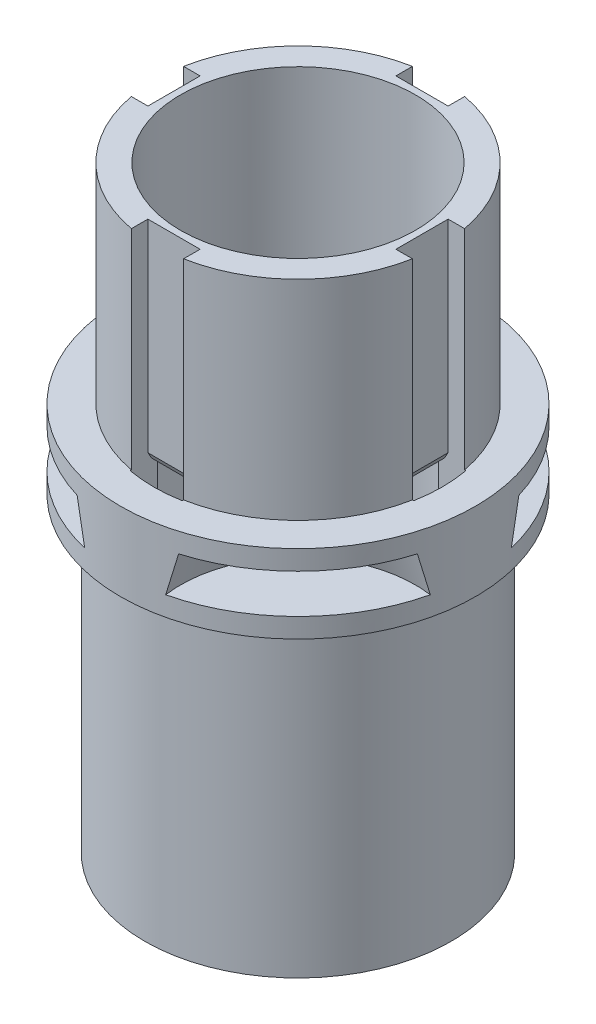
ISO-10303-21;
HEADER;
FILE_DESCRIPTION(('STEP AP214'),'2;1');
FILE_NAME('part.step','',(''),(''),'','','');
FILE_SCHEMA(('AUTOMOTIVE_DESIGN { 1 0 10303 214 1 1 1 1 }'));
ENDSEC;
DATA;
#1=APPLICATION_CONTEXT('core data for automotive mechanical design processes');
#2=APPLICATION_PROTOCOL_DEFINITION('international standard','automotive_design',2000,#1);
#3=PRODUCT_CONTEXT('',#1,'mechanical');
#4=PRODUCT('Part','Part','',(#3));
#5=PRODUCT_RELATED_PRODUCT_CATEGORY('part','',(#4));
#6=PRODUCT_DEFINITION_FORMATION('','',#4);
#7=PRODUCT_DEFINITION_CONTEXT('part definition',#1,'design');
#8=PRODUCT_DEFINITION('design','',#6,#7);
#9=PRODUCT_DEFINITION_SHAPE('','',#8);
#10=(LENGTH_UNIT() NAMED_UNIT(*) SI_UNIT(.MILLI.,.METRE.));
#11=(NAMED_UNIT(*) PLANE_ANGLE_UNIT() SI_UNIT($,.RADIAN.));
#12=(NAMED_UNIT(*) SI_UNIT($,.STERADIAN.) SOLID_ANGLE_UNIT());
#13=UNCERTAINTY_MEASURE_WITH_UNIT(LENGTH_MEASURE(1.E-05),#10,'distance_accuracy_value','');
#14=(GEOMETRIC_REPRESENTATION_CONTEXT(3) GLOBAL_UNCERTAINTY_ASSIGNED_CONTEXT((#13)) GLOBAL_UNIT_ASSIGNED_CONTEXT((#10,
#11,#12)) REPRESENTATION_CONTEXT('',''));
#15=CARTESIAN_POINT('',(0.,0.,0.));
#16=DIRECTION('',(0.,0.,1.));
#17=DIRECTION('',(1.,0.,0.));
#18=AXIS2_PLACEMENT_3D('',#15,#16,#17);
#19=CARTESIAN_POINT('',(0.,45.8,0.));
#20=DIRECTION('',(0.,-1.,0.));
#21=DIRECTION('',(0.,0.,-1.));
#22=AXIS2_PLACEMENT_3D('',#19,#20,#21);
#23=CYLINDRICAL_SURFACE('',#22,10.95);
#24=DIRECTION('',(0.,-1.,0.));
#25=VECTOR('',#24,1.);
#26=CARTESIAN_POINT('',(10.7658023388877,45.8,-1.99999999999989));
#27=LINE('',#26,#25);
#28=CARTESIAN_POINT('',(10.7658023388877,29.8,-1.99999999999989));
#29=VERTEX_POINT('',#28);
#30=CARTESIAN_POINT('',(10.7658023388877,45.8,-1.99999999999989));
#31=VERTEX_POINT('',#30);
#32=EDGE_CURVE('E475',#29,#31,#27,.F.);
#33=ORIENTED_EDGE('',*,*,#32,.F.);
#34=CARTESIAN_POINT('',(0.,29.8,0.));
#35=DIRECTION('',(0.,1.,0.));
#36=DIRECTION('',(0.,0.,1.));
#37=AXIS2_PLACEMENT_3D('',#34,#35,#36);
#38=CIRCLE('',#37,10.95);
#39=CARTESIAN_POINT('',(2.,29.8,-10.7658023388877));
#40=VERTEX_POINT('',#39);
#41=EDGE_CURVE('E832',#29,#40,#38,.T.);
#42=ORIENTED_EDGE('',*,*,#41,.T.);
#43=DIRECTION('',(0.,-1.,0.));
#44=VECTOR('',#43,1.);
#45=CARTESIAN_POINT('',(2.,45.8,-10.7658023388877));
#46=LINE('',#45,#44);
#47=CARTESIAN_POINT('',(2.,45.8,-10.7658023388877));
#48=VERTEX_POINT('',#47);
#49=EDGE_CURVE('E523',#40,#48,#46,.F.);
#50=ORIENTED_EDGE('',*,*,#49,.T.);
#51=CARTESIAN_POINT('',(0.,45.8,0.));
#52=DIRECTION('',(0.,1.,0.));
#53=DIRECTION('',(0.,0.,1.));
#54=AXIS2_PLACEMENT_3D('',#51,#52,#53);
#55=CIRCLE('',#54,10.95);
#56=EDGE_CURVE('E827',#31,#48,#55,.T.);
#57=ORIENTED_EDGE('',*,*,#56,.F.);
#58=EDGE_LOOP('',(#33,#42,#50,#57));
#59=FACE_BOUND('',#58,.T.);
#60=ADVANCED_FACE('F35',(#59),#23,.T.);
#61=DIRECTION('',(0.,-1.,0.));
#62=VECTOR('',#61,1.);
#63=CARTESIAN_POINT('',(-2.,45.8,-10.7658023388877));
#64=LINE('',#63,#62);
#65=CARTESIAN_POINT('',(-2.,29.8,-10.7658023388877));
#66=VERTEX_POINT('',#65);
#67=CARTESIAN_POINT('',(-2.,45.8,-10.7658023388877));
#68=VERTEX_POINT('',#67);
#69=EDGE_CURVE('E511',#66,#68,#64,.F.);
#70=ORIENTED_EDGE('',*,*,#69,.F.);
#71=CARTESIAN_POINT('',(-10.7658023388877,29.8,-2.00000000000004));
#72=VERTEX_POINT('',#71);
#73=EDGE_CURVE('E895',#66,#72,#38,.T.);
#74=ORIENTED_EDGE('',*,*,#73,.T.);
#75=DIRECTION('',(0.,-1.,0.));
#76=VECTOR('',#75,1.);
#77=CARTESIAN_POINT('',(-10.7658023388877,45.8,-2.00000000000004));
#78=LINE('',#77,#76);
#79=CARTESIAN_POINT('',(-10.7658023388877,45.8,-2.00000000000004));
#80=VERTEX_POINT('',#79);
#81=EDGE_CURVE('E559',#72,#80,#78,.F.);
#82=ORIENTED_EDGE('',*,*,#81,.T.);
#83=EDGE_CURVE('E1134',#68,#80,#55,.T.);
#84=ORIENTED_EDGE('',*,*,#83,.F.);
#85=EDGE_LOOP('',(#70,#74,#82,#84));
#86=FACE_BOUND('',#85,.T.);
#87=ADVANCED_FACE('F859',(#86),#23,.T.);
#88=DIRECTION('',(0.,-1.,0.));
#89=VECTOR('',#88,1.);
#90=CARTESIAN_POINT('',(-10.7658023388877,45.8,1.99999999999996));
#91=LINE('',#90,#89);
#92=CARTESIAN_POINT('',(-10.7658023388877,29.8,1.99999999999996));
#93=VERTEX_POINT('',#92);
#94=CARTESIAN_POINT('',(-10.7658023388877,45.8,1.99999999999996));
#95=VERTEX_POINT('',#94);
#96=EDGE_CURVE('E547',#93,#95,#91,.F.);
#97=ORIENTED_EDGE('',*,*,#96,.F.);
#98=CARTESIAN_POINT('',(-2.,29.8,10.7658023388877));
#99=VERTEX_POINT('',#98);
#100=EDGE_CURVE('E820',#93,#99,#38,.T.);
#101=ORIENTED_EDGE('',*,*,#100,.T.);
#102=DIRECTION('',(0.,-1.,0.));
#103=VECTOR('',#102,1.);
#104=CARTESIAN_POINT('',(-2.,45.8,10.7658023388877));
#105=LINE('',#104,#103);
#106=CARTESIAN_POINT('',(-2.,45.8,10.7658023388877));
#107=VERTEX_POINT('',#106);
#108=EDGE_CURVE('E595',#99,#107,#105,.F.);
#109=ORIENTED_EDGE('',*,*,#108,.T.);
#110=EDGE_CURVE('E828',#95,#107,#55,.T.);
#111=ORIENTED_EDGE('',*,*,#110,.F.);
#112=EDGE_LOOP('',(#97,#101,#109,#111));
#113=FACE_BOUND('',#112,.T.);
#114=ADVANCED_FACE('F866',(#113),#23,.T.);
#115=CARTESIAN_POINT('',(0.,29.8,0.));
#116=DIRECTION('',(0.,1.,0.));
#117=DIRECTION('',(0.,0.,1.));
#118=AXIS2_PLACEMENT_3D('',#115,#116,#117);
#119=PLANE('',#118);
#120=DIRECTION('',(1.,0.,0.));
#121=VECTOR('',#120,1.);
#122=CARTESIAN_POINT('',(0.,29.8,2.));
#123=LINE('',#122,#121);
#124=CARTESIAN_POINT('',(10.7658023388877,29.8,2.00000000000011));
#125=VERTEX_POINT('',#124);
#126=CARTESIAN_POINT('',(10.867497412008,29.8,2.00000000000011));
#127=VERTEX_POINT('',#126);
#128=EDGE_CURVE('E490',#125,#127,#123,.T.);
#129=ORIENTED_EDGE('',*,*,#128,.F.);
#130=CARTESIAN_POINT('',(2.,29.8,10.7658023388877));
#131=VERTEX_POINT('',#130);
#132=EDGE_CURVE('E829',#131,#125,#38,.T.);
#133=ORIENTED_EDGE('',*,*,#132,.F.);
#134=DIRECTION('',(0.,0.,1.));
#135=VECTOR('',#134,1.);
#136=CARTESIAN_POINT('',(2.,29.8,0.));
#137=LINE('',#136,#135);
#138=CARTESIAN_POINT('',(2.,29.8,10.867497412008));
#139=VERTEX_POINT('',#138);
#140=EDGE_CURVE('E592',#131,#139,#137,.T.);
#141=ORIENTED_EDGE('',*,*,#140,.T.);
#142=CARTESIAN_POINT('',(0.,29.8,0.));
#143=DIRECTION('',(0.,1.,0.));
#144=DIRECTION('',(0.,0.,1.));
#145=AXIS2_PLACEMENT_3D('',#142,#143,#144);
#146=CIRCLE('',#145,11.05);
#147=CARTESIAN_POINT('',(-2.,29.8,10.867497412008));
#148=VERTEX_POINT('',#147);
#149=EDGE_CURVE('E655',#139,#148,#146,.F.);
#150=ORIENTED_EDGE('',*,*,#149,.T.);
#151=DIRECTION('',(0.,0.,1.));
#152=VECTOR('',#151,1.);
#153=CARTESIAN_POINT('',(-2.,29.8,0.));
#154=LINE('',#153,#152);
#155=EDGE_CURVE('E598',#99,#148,#154,.T.);
#156=ORIENTED_EDGE('',*,*,#155,.F.);
#157=ORIENTED_EDGE('',*,*,#100,.F.);
#158=DIRECTION('',(-1.,0.,0.));
#159=VECTOR('',#158,1.);
#160=CARTESIAN_POINT('',(0.,29.8,2.));
#161=LINE('',#160,#159);
#162=CARTESIAN_POINT('',(-10.867497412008,29.8,1.99999999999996));
#163=VERTEX_POINT('',#162);
#164=EDGE_CURVE('E556',#93,#163,#161,.T.);
#165=ORIENTED_EDGE('',*,*,#164,.T.);
#166=CARTESIAN_POINT('',(0.,29.8,0.));
#167=DIRECTION('',(0.,1.,0.));
#168=DIRECTION('',(0.,0.,1.));
#169=AXIS2_PLACEMENT_3D('',#166,#167,#168);
#170=CIRCLE('',#169,11.05);
#171=CARTESIAN_POINT('',(-10.867497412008,29.8,-2.00000000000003));
#172=VERTEX_POINT('',#171);
#173=EDGE_CURVE('E912',#163,#172,#170,.F.);
#174=ORIENTED_EDGE('',*,*,#173,.T.);
#175=DIRECTION('',(-1.,0.,0.));
#176=VECTOR('',#175,1.);
#177=CARTESIAN_POINT('',(0.,29.8,-2.));
#178=LINE('',#177,#176);
#179=EDGE_CURVE('E562',#72,#172,#178,.T.);
#180=ORIENTED_EDGE('',*,*,#179,.F.);
#181=ORIENTED_EDGE('',*,*,#73,.F.);
#182=DIRECTION('',(0.,0.,-1.));
#183=VECTOR('',#182,1.);
#184=CARTESIAN_POINT('',(-2.,29.8,0.));
#185=LINE('',#184,#183);
#186=CARTESIAN_POINT('',(-2.,29.8,-10.867497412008));
#187=VERTEX_POINT('',#186);
#188=EDGE_CURVE('E520',#66,#187,#185,.T.);
#189=ORIENTED_EDGE('',*,*,#188,.T.);
#190=CARTESIAN_POINT('',(0.,29.8,0.));
#191=DIRECTION('',(0.,1.,0.));
#192=DIRECTION('',(0.,0.,1.));
#193=AXIS2_PLACEMENT_3D('',#190,#191,#192);
#194=CIRCLE('',#193,11.05);
#195=CARTESIAN_POINT('',(2.,29.8,-10.867497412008));
#196=VERTEX_POINT('',#195);
#197=EDGE_CURVE('E908',#187,#196,#194,.F.);
#198=ORIENTED_EDGE('',*,*,#197,.T.);
#199=DIRECTION('',(0.,0.,-1.));
#200=VECTOR('',#199,1.);
#201=CARTESIAN_POINT('',(2.,29.8,0.));
#202=LINE('',#201,#200);
#203=EDGE_CURVE('E526',#40,#196,#202,.T.);
#204=ORIENTED_EDGE('',*,*,#203,.F.);
#205=ORIENTED_EDGE('',*,*,#41,.F.);
#206=DIRECTION('',(1.,0.,0.));
#207=VECTOR('',#206,1.);
#208=CARTESIAN_POINT('',(0.,29.8,-2.));
#209=LINE('',#208,#207);
#210=CARTESIAN_POINT('',(10.867497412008,29.8,-1.99999999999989));
#211=VERTEX_POINT('',#210);
#212=EDGE_CURVE('E484',#29,#211,#209,.T.);
#213=ORIENTED_EDGE('',*,*,#212,.T.);
#214=CARTESIAN_POINT('',(0.,29.8,0.));
#215=DIRECTION('',(0.,1.,0.));
#216=DIRECTION('',(0.,0.,1.));
#217=AXIS2_PLACEMENT_3D('',#214,#215,#216);
#218=CIRCLE('',#217,11.05);
#219=EDGE_CURVE('E911',#211,#127,#218,.F.);
#220=ORIENTED_EDGE('',*,*,#219,.T.);
#221=EDGE_LOOP('',(#129,#133,#141,#150,#156,#157,#165,#174,#180,#181,#189,#198,#204,#205,#213,#220));
#222=FACE_BOUND('',#221,.T.);
#223=CARTESIAN_POINT('',(0.,29.8,0.));
#224=DIRECTION('',(0.,1.,0.));
#225=DIRECTION('',(0.,0.,1.));
#226=AXIS2_PLACEMENT_3D('',#223,#224,#225);
#227=CIRCLE('',#226,13.6);
#228=CARTESIAN_POINT('',(0.,29.8,13.6));
#229=VERTEX_POINT('',#228);
#230=EDGE_CURVE('E833',#229,#229,#227,.T.);
#231=ORIENTED_EDGE('',*,*,#230,.T.);
#232=EDGE_LOOP('',(#231));
#233=FACE_BOUND('',#232,.T.);
#234=ADVANCED_FACE('F855',(#222,#233),#119,.T.);
#235=CARTESIAN_POINT('',(0.,23.8,0.));
#236=DIRECTION('',(0.,-1.,0.));
#237=DIRECTION('',(0.,0.,-1.));
#238=AXIS2_PLACEMENT_3D('',#235,#236,#237);
#239=CYLINDRICAL_SURFACE('',#238,11.74);
#240=CARTESIAN_POINT('',(0.,23.8,0.));
#241=DIRECTION('',(0.,1.,0.));
#242=DIRECTION('',(0.,0.,1.));
#243=AXIS2_PLACEMENT_3D('',#240,#241,#242);
#244=CIRCLE('',#243,11.74);
#245=CARTESIAN_POINT('',(0.,23.8,11.74));
#246=VERTEX_POINT('',#245);
#247=EDGE_CURVE('E839',#246,#246,#244,.T.);
#248=ORIENTED_EDGE('',*,*,#247,.F.);
#249=EDGE_LOOP('',(#248));
#250=FACE_BOUND('',#249,.T.);
#251=CARTESIAN_POINT('',(0.,0.,0.));
#252=DIRECTION('',(0.,1.,0.));
#253=DIRECTION('',(0.,0.,1.));
#254=AXIS2_PLACEMENT_3D('',#251,#252,#253);
#255=CIRCLE('',#254,11.74);
#256=CARTESIAN_POINT('',(0.,0.,11.74));
#257=VERTEX_POINT('',#256);
#258=EDGE_CURVE('E836',#257,#257,#255,.T.);
#259=ORIENTED_EDGE('',*,*,#258,.T.);
#260=EDGE_LOOP('',(#259));
#261=FACE_BOUND('',#260,.T.);
#262=ADVANCED_FACE('F844',(#250,#261),#239,.T.);
#263=CARTESIAN_POINT('',(0.,0.,0.));
#264=DIRECTION('',(0.,1.,0.));
#265=DIRECTION('',(0.,0.,1.));
#266=AXIS2_PLACEMENT_3D('',#263,#264,#265);
#267=PLANE('',#266);
#268=CARTESIAN_POINT('',(0.,0.,0.));
#269=DIRECTION('',(0.,1.,0.));
#270=DIRECTION('',(0.,0.,1.));
#271=AXIS2_PLACEMENT_3D('',#268,#269,#270);
#272=CIRCLE('',#271,9.);
#273=CARTESIAN_POINT('',(0.,0.,9.));
#274=VERTEX_POINT('',#273);
#275=EDGE_CURVE('E817',#274,#274,#272,.T.);
#276=ORIENTED_EDGE('',*,*,#275,.T.);
#277=EDGE_LOOP('',(#276));
#278=FACE_BOUND('',#277,.T.);
#279=ORIENTED_EDGE('',*,*,#258,.F.);
#280=EDGE_LOOP('',(#279));
#281=FACE_BOUND('',#280,.T.);
#282=ADVANCED_FACE('F846',(#278,#281),#267,.F.);
#283=CARTESIAN_POINT('',(0.,23.8,0.));
#284=DIRECTION('',(0.,1.,0.));
#285=DIRECTION('',(0.,0.,1.));
#286=AXIS2_PLACEMENT_3D('',#283,#284,#285);
#287=PLANE('',#286);
#288=CARTESIAN_POINT('',(0.,23.8,0.));
#289=DIRECTION('',(0.,1.,0.));
#290=DIRECTION('',(0.,0.,1.));
#291=AXIS2_PLACEMENT_3D('',#288,#289,#290);
#292=CIRCLE('',#291,13.6);
#293=CARTESIAN_POINT('',(0.,23.8,13.6));
#294=VERTEX_POINT('',#293);
#295=EDGE_CURVE('E826',#294,#294,#292,.T.);
#296=ORIENTED_EDGE('',*,*,#295,.F.);
#297=EDGE_LOOP('',(#296));
#298=FACE_BOUND('',#297,.T.);
#299=ORIENTED_EDGE('',*,*,#247,.T.);
#300=EDGE_LOOP('',(#299));
#301=FACE_BOUND('',#300,.T.);
#302=ADVANCED_FACE('F848',(#298,#301),#287,.F.);
#303=CARTESIAN_POINT('',(0.,29.8,0.));
#304=DIRECTION('',(0.,-1.,0.));
#305=DIRECTION('',(0.,0.,-1.));
#306=AXIS2_PLACEMENT_3D('',#303,#304,#305);
#307=CYLINDRICAL_SURFACE('',#306,13.6);
#308=CARTESIAN_POINT('',(0.,28.3,0.));
#309=DIRECTION('',(0.,1.,0.));
#310=DIRECTION('',(-1.,0.,0.));
#311=AXIS2_PLACEMENT_3D('',#308,#309,#310);
#312=CIRCLE('',#311,13.6);
#313=CARTESIAN_POINT('',(-3.88735233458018,28.3,-13.032593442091));
#314=VERTEX_POINT('',#313);
#315=CARTESIAN_POINT('',(-13.032593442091,28.3,-3.88735233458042));
#316=VERTEX_POINT('',#315);
#317=EDGE_CURVE('E1553',#314,#316,#312,.T.);
#318=ORIENTED_EDGE('',*,*,#317,.T.);
#319=CARTESIAN_POINT('',(-13.032577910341,28.3002,-3.88740440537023));
#320=CARTESIAN_POINT('',(-13.0713722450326,27.8002927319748,-3.7572811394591));
#321=CARTESIAN_POINT('',(-13.1081439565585,27.3003057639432,-3.62692486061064));
#322=CARTESIAN_POINT('',(-13.1776421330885,26.300172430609,-3.36574627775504));
#323=CARTESIAN_POINT('',(-13.2103685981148,25.8000260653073,-3.23492397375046));
#324=CARTESIAN_POINT('',(-13.2410724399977,25.2998,-3.1038686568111));
#325=B_SPLINE_CURVE_WITH_KNOTS('',3,(#319,#320,#321,#322,#323,#324),.UNSPECIFIED.,.F.,.F.,(4,2,
4),(0.,1.55402283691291,3.1080456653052),.UNSPECIFIED.);
#326=CARTESIAN_POINT('',(-13.241060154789,25.3,-3.10392106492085));
#327=VERTEX_POINT('',#326);
#328=EDGE_CURVE('E615',#316,#327,#325,.T.);
#329=ORIENTED_EDGE('',*,*,#328,.T.);
#330=CARTESIAN_POINT('',(0.,25.3,0.));
#331=DIRECTION('',(0.,-1.,0.));
#332=DIRECTION('',(1.,0.,0.));
#333=AXIS2_PLACEMENT_3D('',#330,#331,#332);
#334=CIRCLE('',#333,13.6);
#335=CARTESIAN_POINT('',(-3.10392106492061,25.3,-13.241060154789));
#336=VERTEX_POINT('',#335);
#337=EDGE_CURVE('E1555',#327,#336,#334,.T.);
#338=ORIENTED_EDGE('',*,*,#337,.T.);
#339=CARTESIAN_POINT('',(-3.10386865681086,25.2998,-13.2410724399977));
#340=CARTESIAN_POINT('',(-3.23492397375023,25.8000260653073,-13.2103685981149));
#341=CARTESIAN_POINT('',(-3.3657462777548,26.300172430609,-13.1776421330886));
#342=CARTESIAN_POINT('',(-3.6269248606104,27.3003057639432,-13.1081439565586));
#343=CARTESIAN_POINT('',(-3.75728113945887,27.8002927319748,-13.0713722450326));
#344=CARTESIAN_POINT('',(-3.88740440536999,28.3002,-13.0325779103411));
#345=B_SPLINE_CURVE_WITH_KNOTS('',3,(#339,#340,#341,#342,#343,#344),.UNSPECIFIED.,.F.,.F.,(4,2,
4),(0.,1.55402282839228,3.10804566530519),.UNSPECIFIED.);
#346=EDGE_CURVE('E607',#336,#314,#345,.T.);
#347=ORIENTED_EDGE('',*,*,#346,.T.);
#348=EDGE_LOOP('',(#318,#329,#338,#347));
#349=FACE_BOUND('',#348,.T.);
#350=CARTESIAN_POINT('',(0.,28.3,0.));
#351=DIRECTION('',(0.,1.,0.));
#352=DIRECTION('',(0.,0.,1.));
#353=AXIS2_PLACEMENT_3D('',#350,#351,#352);
#354=CIRCLE('',#353,13.6);
#355=CARTESIAN_POINT('',(-13.032593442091,28.3,3.88735233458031));
#356=VERTEX_POINT('',#355);
#357=CARTESIAN_POINT('',(-3.88735233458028,28.3,13.032593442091));
#358=VERTEX_POINT('',#357);
#359=EDGE_CURVE('E743',#356,#358,#354,.T.);
#360=ORIENTED_EDGE('',*,*,#359,.T.);
#361=CARTESIAN_POINT('',(-3.88740440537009,28.3002,13.032577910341));
#362=CARTESIAN_POINT('',(-3.75728113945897,27.8002927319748,13.0713722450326));
#363=CARTESIAN_POINT('',(-3.6269248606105,27.3003057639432,13.1081439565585));
#364=CARTESIAN_POINT('',(-3.3657462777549,26.300172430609,13.1776421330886));
#365=CARTESIAN_POINT('',(-3.23492397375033,25.8000260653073,13.2103685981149));
#366=CARTESIAN_POINT('',(-3.10386865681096,25.2998,13.2410724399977));
#367=B_SPLINE_CURVE_WITH_KNOTS('',3,(#361,#362,#363,#364,#365,#366),.UNSPECIFIED.,.F.,.F.,(4,2,
4),(0.,1.55402283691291,3.1080456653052),.UNSPECIFIED.);
#368=CARTESIAN_POINT('',(-3.10392106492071,25.3,13.241060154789));
#369=VERTEX_POINT('',#368);
#370=EDGE_CURVE('E734',#358,#369,#367,.T.);
#371=ORIENTED_EDGE('',*,*,#370,.T.);
#372=CARTESIAN_POINT('',(0.,25.3,0.));
#373=DIRECTION('',(0.,-1.,0.));
#374=DIRECTION('',(0.,0.,-1.));
#375=AXIS2_PLACEMENT_3D('',#372,#373,#374);
#376=CIRCLE('',#375,13.6);
#377=CARTESIAN_POINT('',(-13.241060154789,25.3,3.10392106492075));
#378=VERTEX_POINT('',#377);
#379=EDGE_CURVE('E746',#369,#378,#376,.T.);
#380=ORIENTED_EDGE('',*,*,#379,.T.);
#381=CARTESIAN_POINT('',(-13.2410724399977,25.2998,3.103868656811));
#382=CARTESIAN_POINT('',(-13.2103685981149,25.8000260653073,3.23492397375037));
#383=CARTESIAN_POINT('',(-13.1776421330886,26.300172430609,3.36574627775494));
#384=CARTESIAN_POINT('',(-13.1081439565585,27.3003057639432,3.62692486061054));
#385=CARTESIAN_POINT('',(-13.0713722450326,27.8002927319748,3.75728113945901));
#386=CARTESIAN_POINT('',(-13.032577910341,28.3002,3.88740440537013));
#387=B_SPLINE_CURVE_WITH_KNOTS('',3,(#381,#382,#383,#384,#385,#386),.UNSPECIFIED.,.F.,.F.,(4,2,
4),(0.,1.55402282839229,3.1080456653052),.UNSPECIFIED.);
#388=EDGE_CURVE('E728',#378,#356,#387,.T.);
#389=ORIENTED_EDGE('',*,*,#388,.T.);
#390=EDGE_LOOP('',(#360,#371,#380,#389));
#391=FACE_BOUND('',#390,.T.);
#392=CARTESIAN_POINT('',(0.,28.3,0.));
#393=DIRECTION('',(0.,1.,0.));
#394=DIRECTION('',(-1.,0.,0.));
#395=AXIS2_PLACEMENT_3D('',#392,#393,#394);
#396=CIRCLE('',#395,13.6);
#397=CARTESIAN_POINT('',(3.88735233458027,28.3,13.032593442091));
#398=VERTEX_POINT('',#397);
#399=CARTESIAN_POINT('',(13.032593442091,28.3,3.88735233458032));
#400=VERTEX_POINT('',#399);
#401=EDGE_CURVE('E1601',#398,#400,#396,.T.);
#402=ORIENTED_EDGE('',*,*,#401,.T.);
#403=CARTESIAN_POINT('',(13.032577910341,28.3002,3.88740440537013));
#404=CARTESIAN_POINT('',(13.0713722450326,27.8002927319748,3.75728113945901));
#405=CARTESIAN_POINT('',(13.1081439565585,27.3003057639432,3.62692486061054));
#406=CARTESIAN_POINT('',(13.1776421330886,26.300172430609,3.36574627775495));
#407=CARTESIAN_POINT('',(13.2103685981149,25.8000260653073,3.23492397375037));
#408=CARTESIAN_POINT('',(13.2410724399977,25.2998,3.10386865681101));
#409=B_SPLINE_CURVE_WITH_KNOTS('',3,(#403,#404,#405,#406,#407,#408),.UNSPECIFIED.,.F.,.F.,(4,2,
4),(0.,1.55402283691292,3.1080456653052),.UNSPECIFIED.);
#410=CARTESIAN_POINT('',(13.241060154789,25.3,3.10392106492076));
#411=VERTEX_POINT('',#410);
#412=EDGE_CURVE('E762',#400,#411,#409,.T.);
#413=ORIENTED_EDGE('',*,*,#412,.T.);
#414=CARTESIAN_POINT('',(0.,25.3,0.));
#415=DIRECTION('',(0.,-1.,0.));
#416=DIRECTION('',(1.,0.,0.));
#417=AXIS2_PLACEMENT_3D('',#414,#415,#416);
#418=CIRCLE('',#417,13.6);
#419=CARTESIAN_POINT('',(3.1039210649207,25.3,13.241060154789));
#420=VERTEX_POINT('',#419);
#421=EDGE_CURVE('E1598',#411,#420,#418,.T.);
#422=ORIENTED_EDGE('',*,*,#421,.T.);
#423=CARTESIAN_POINT('',(3.10386865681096,25.2998,13.2410724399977));
#424=CARTESIAN_POINT('',(3.23492397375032,25.8000260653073,13.2103685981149));
#425=CARTESIAN_POINT('',(3.3657462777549,26.300172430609,13.1776421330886));
#426=CARTESIAN_POINT('',(3.62692486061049,27.3003057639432,13.1081439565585));
#427=CARTESIAN_POINT('',(3.75728113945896,27.8002927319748,13.0713722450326));
#428=CARTESIAN_POINT('',(3.88740440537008,28.3002,13.032577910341));
#429=B_SPLINE_CURVE_WITH_KNOTS('',3,(#423,#424,#425,#426,#427,#428),.UNSPECIFIED.,.F.,.F.,(4,2,
4),(0.,1.55402282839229,3.1080456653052),.UNSPECIFIED.);
#430=EDGE_CURVE('E756',#420,#398,#429,.T.);
#431=ORIENTED_EDGE('',*,*,#430,.T.);
#432=EDGE_LOOP('',(#402,#413,#422,#431));
#433=FACE_BOUND('',#432,.T.);
#434=CARTESIAN_POINT('',(0.,28.3,0.));
#435=DIRECTION('',(0.,1.,0.));
#436=DIRECTION('',(0.,0.,1.));
#437=AXIS2_PLACEMENT_3D('',#434,#435,#436);
#438=CIRCLE('',#437,13.6);
#439=CARTESIAN_POINT('',(13.032593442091,28.3,-3.88735233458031));
#440=VERTEX_POINT('',#439);
#441=CARTESIAN_POINT('',(3.88735233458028,28.3,-13.032593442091));
#442=VERTEX_POINT('',#441);
#443=EDGE_CURVE('E810',#440,#442,#438,.T.);
#444=ORIENTED_EDGE('',*,*,#443,.T.);
#445=CARTESIAN_POINT('',(3.88740440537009,28.3002,-13.032577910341));
#446=CARTESIAN_POINT('',(3.75728113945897,27.8002927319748,-13.0713722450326));
#447=CARTESIAN_POINT('',(3.6269248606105,27.3003057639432,-13.1081439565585));
#448=CARTESIAN_POINT('',(3.3657462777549,26.300172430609,-13.1776421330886));
#449=CARTESIAN_POINT('',(3.23492397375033,25.8000260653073,-13.2103685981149));
#450=CARTESIAN_POINT('',(3.10386865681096,25.2998,-13.2410724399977));
#451=B_SPLINE_CURVE_WITH_KNOTS('',3,(#445,#446,#447,#448,#449,#450),.UNSPECIFIED.,.F.,.F.,(4,2,
4),(0.,1.55402283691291,3.1080456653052),.UNSPECIFIED.);
#452=CARTESIAN_POINT('',(3.10392106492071,25.3,-13.241060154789));
#453=VERTEX_POINT('',#452);
#454=EDGE_CURVE('E801',#442,#453,#451,.T.);
#455=ORIENTED_EDGE('',*,*,#454,.T.);
#456=CARTESIAN_POINT('',(0.,25.3,0.));
#457=DIRECTION('',(0.,-1.,0.));
#458=DIRECTION('',(0.,0.,-1.));
#459=AXIS2_PLACEMENT_3D('',#456,#457,#458);
#460=CIRCLE('',#459,13.6);
#461=CARTESIAN_POINT('',(13.241060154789,25.3,-3.10392106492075));
#462=VERTEX_POINT('',#461);
#463=EDGE_CURVE('E813',#453,#462,#460,.T.);
#464=ORIENTED_EDGE('',*,*,#463,.T.);
#465=CARTESIAN_POINT('',(13.2410724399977,25.2998,-3.103868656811));
#466=CARTESIAN_POINT('',(13.2103685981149,25.8000260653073,-3.23492397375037));
#467=CARTESIAN_POINT('',(13.1776421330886,26.300172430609,-3.36574627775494));
#468=CARTESIAN_POINT('',(13.1081439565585,27.3003057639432,-3.62692486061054));
#469=CARTESIAN_POINT('',(13.0713722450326,27.8002927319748,-3.75728113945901));
#470=CARTESIAN_POINT('',(13.032577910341,28.3002,-3.88740440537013));
#471=B_SPLINE_CURVE_WITH_KNOTS('',3,(#465,#466,#467,#468,#469,#470),.UNSPECIFIED.,.F.,.F.,(4,2,
4),(0.,1.55402282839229,3.1080456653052),.UNSPECIFIED.);
#472=EDGE_CURVE('E795',#462,#440,#471,.T.);
#473=ORIENTED_EDGE('',*,*,#472,.T.);
#474=EDGE_LOOP('',(#444,#455,#464,#473));
#475=FACE_BOUND('',#474,.T.);
#476=ORIENTED_EDGE('',*,*,#230,.F.);
#477=EDGE_LOOP('',(#476));
#478=FACE_BOUND('',#477,.T.);
#479=ORIENTED_EDGE('',*,*,#295,.T.);
#480=EDGE_LOOP('',(#479));
#481=FACE_BOUND('',#480,.T.);
#482=ADVANCED_FACE('F620',(#349,#391,#433,#475,#478,#481),#307,.T.);
#483=ORIENTED_EDGE('',*,*,#132,.T.);
#484=DIRECTION('',(0.,-1.,0.));
#485=VECTOR('',#484,1.);
#486=CARTESIAN_POINT('',(10.7658023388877,45.8,2.00000000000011));
#487=LINE('',#486,#485);
#488=CARTESIAN_POINT('',(10.7658023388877,45.8,2.00000000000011));
#489=VERTEX_POINT('',#488);
#490=EDGE_CURVE('E487',#125,#489,#487,.F.);
#491=ORIENTED_EDGE('',*,*,#490,.T.);
#492=CARTESIAN_POINT('',(2.,45.8,10.7658023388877));
#493=VERTEX_POINT('',#492);
#494=EDGE_CURVE('E823',#493,#489,#55,.T.);
#495=ORIENTED_EDGE('',*,*,#494,.F.);
#496=DIRECTION('',(0.,-1.,0.));
#497=VECTOR('',#496,1.);
#498=CARTESIAN_POINT('',(2.,45.8,10.7658023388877));
#499=LINE('',#498,#497);
#500=EDGE_CURVE('E583',#131,#493,#499,.F.);
#501=ORIENTED_EDGE('',*,*,#500,.F.);
#502=EDGE_LOOP('',(#483,#491,#495,#501));
#503=FACE_BOUND('',#502,.T.);
#504=ADVANCED_FACE('F861',(#503),#23,.T.);
#505=CARTESIAN_POINT('',(0.,45.8,0.));
#506=DIRECTION('',(0.,1.,0.));
#507=DIRECTION('',(0.,0.,1.));
#508=AXIS2_PLACEMENT_3D('',#505,#506,#507);
#509=PLANE('',#508);
#510=DIRECTION('',(1.,0.,0.));
#511=VECTOR('',#510,1.);
#512=CARTESIAN_POINT('',(9.49999999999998,45.8,2.0000000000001));
#513=LINE('',#512,#511);
#514=CARTESIAN_POINT('',(9.49999999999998,45.8,2.0000000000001));
#515=VERTEX_POINT('',#514);
#516=EDGE_CURVE('E457',#515,#489,#513,.T.);
#517=ORIENTED_EDGE('',*,*,#516,.F.);
#518=DIRECTION('',(0.,0.,-1.));
#519=VECTOR('',#518,1.);
#520=CARTESIAN_POINT('',(9.49999999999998,45.8,2.0000000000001));
#521=LINE('',#520,#519);
#522=CARTESIAN_POINT('',(9.50000000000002,45.8,-1.9999999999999));
#523=VERTEX_POINT('',#522);
#524=EDGE_CURVE('E461',#515,#523,#521,.T.);
#525=ORIENTED_EDGE('',*,*,#524,.T.);
#526=DIRECTION('',(1.,0.,0.));
#527=VECTOR('',#526,1.);
#528=CARTESIAN_POINT('',(9.50000000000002,45.8,-1.9999999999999));
#529=LINE('',#528,#527);
#530=EDGE_CURVE('E468',#523,#31,#529,.T.);
#531=ORIENTED_EDGE('',*,*,#530,.T.);
#532=ORIENTED_EDGE('',*,*,#56,.T.);
#533=DIRECTION('',(0.,0.,-1.));
#534=VECTOR('',#533,1.);
#535=CARTESIAN_POINT('',(2.,45.8,-9.5));
#536=LINE('',#535,#534);
#537=CARTESIAN_POINT('',(2.,45.8,-9.5));
#538=VERTEX_POINT('',#537);
#539=EDGE_CURVE('E492',#538,#48,#536,.T.);
#540=ORIENTED_EDGE('',*,*,#539,.F.);
#541=DIRECTION('',(-1.,0.,0.));
#542=VECTOR('',#541,1.);
#543=CARTESIAN_POINT('',(2.,45.8,-9.5));
#544=LINE('',#543,#542);
#545=CARTESIAN_POINT('',(-2.,45.8,-9.5));
#546=VERTEX_POINT('',#545);
#547=EDGE_CURVE('E496',#538,#546,#544,.T.);
#548=ORIENTED_EDGE('',*,*,#547,.T.);
#549=DIRECTION('',(0.,0.,-1.));
#550=VECTOR('',#549,1.);
#551=CARTESIAN_POINT('',(-2.,45.8,-9.5));
#552=LINE('',#551,#550);
#553=EDGE_CURVE('E504',#546,#68,#552,.T.);
#554=ORIENTED_EDGE('',*,*,#553,.T.);
#555=ORIENTED_EDGE('',*,*,#83,.T.);
#556=DIRECTION('',(-1.,0.,0.));
#557=VECTOR('',#556,1.);
#558=CARTESIAN_POINT('',(-9.49999999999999,45.8,-2.00000000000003));
#559=LINE('',#558,#557);
#560=CARTESIAN_POINT('',(-9.49999999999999,45.8,-2.00000000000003));
#561=VERTEX_POINT('',#560);
#562=EDGE_CURVE('E528',#561,#80,#559,.T.);
#563=ORIENTED_EDGE('',*,*,#562,.F.);
#564=DIRECTION('',(0.,0.,1.));
#565=VECTOR('',#564,1.);
#566=CARTESIAN_POINT('',(-9.49999999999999,45.8,-2.00000000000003));
#567=LINE('',#566,#565);
#568=CARTESIAN_POINT('',(-9.50000000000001,45.8,1.99999999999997));
#569=VERTEX_POINT('',#568);
#570=EDGE_CURVE('E532',#561,#569,#567,.T.);
#571=ORIENTED_EDGE('',*,*,#570,.T.);
#572=DIRECTION('',(-1.,0.,0.));
#573=VECTOR('',#572,1.);
#574=CARTESIAN_POINT('',(-9.50000000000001,45.8,1.99999999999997));
#575=LINE('',#574,#573);
#576=EDGE_CURVE('E540',#569,#95,#575,.T.);
#577=ORIENTED_EDGE('',*,*,#576,.T.);
#578=ORIENTED_EDGE('',*,*,#110,.T.);
#579=DIRECTION('',(0.,0.,1.));
#580=VECTOR('',#579,1.);
#581=CARTESIAN_POINT('',(-2.,45.8,9.5));
#582=LINE('',#581,#580);
#583=CARTESIAN_POINT('',(-2.,45.8,9.5));
#584=VERTEX_POINT('',#583);
#585=EDGE_CURVE('E564',#584,#107,#582,.T.);
#586=ORIENTED_EDGE('',*,*,#585,.F.);
#587=DIRECTION('',(1.,0.,0.));
#588=VECTOR('',#587,1.);
#589=CARTESIAN_POINT('',(-2.,45.8,9.5));
#590=LINE('',#589,#588);
#591=CARTESIAN_POINT('',(2.,45.8,9.5));
#592=VERTEX_POINT('',#591);
#593=EDGE_CURVE('E568',#584,#592,#590,.T.);
#594=ORIENTED_EDGE('',*,*,#593,.T.);
#595=DIRECTION('',(0.,0.,1.));
#596=VECTOR('',#595,1.);
#597=CARTESIAN_POINT('',(2.,45.8,9.5));
#598=LINE('',#597,#596);
#599=EDGE_CURVE('E576',#592,#493,#598,.T.);
#600=ORIENTED_EDGE('',*,*,#599,.T.);
#601=ORIENTED_EDGE('',*,*,#494,.T.);
#602=EDGE_LOOP('',(#517,#525,#531,#532,#540,#548,#554,#555,#563,#571,#577,#578,#586,#594,#600,#601));
#603=FACE_BOUND('',#602,.T.);
#604=CARTESIAN_POINT('',(0.,45.8,0.));
#605=DIRECTION('',(0.,1.,0.));
#606=DIRECTION('',(0.,0.,1.));
#607=AXIS2_PLACEMENT_3D('',#604,#605,#606);
#608=CIRCLE('',#607,9.);
#609=CARTESIAN_POINT('',(0.,45.8,9.));
#610=VERTEX_POINT('',#609);
#611=EDGE_CURVE('E816',#610,#610,#608,.T.);
#612=ORIENTED_EDGE('',*,*,#611,.F.);
#613=EDGE_LOOP('',(#612));
#614=FACE_BOUND('',#613,.T.);
#615=ADVANCED_FACE('F663',(#603,#614),#509,.T.);
#616=CARTESIAN_POINT('',(0.,0.,0.));
#617=DIRECTION('',(0.,1.,0.));
#618=DIRECTION('',(0.,0.,1.));
#619=AXIS2_PLACEMENT_3D('',#616,#617,#618);
#620=CYLINDRICAL_SURFACE('',#619,9.);
#621=CARTESIAN_POINT('',(0.,27.5494446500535,0.));
#622=DIRECTION('',(0.,-1.,0.));
#623=DIRECTION('',(0.,0.,-1.));
#624=AXIS2_PLACEMENT_3D('',#621,#622,#623);
#625=CIRCLE('',#624,9.);
#626=CARTESIAN_POINT('',(2.00000000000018,27.5494446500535,-8.77496438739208));
#627=VERTEX_POINT('',#626);
#628=CARTESIAN_POINT('',(-1.99999999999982,27.5494446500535,-8.77496438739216));
#629=VERTEX_POINT('',#628);
#630=EDGE_CURVE('E411',#627,#629,#625,.F.);
#631=ORIENTED_EDGE('',*,*,#630,.T.);
#632=DIRECTION('',(0.,1.,0.));
#633=VECTOR('',#632,1.);
#634=CARTESIAN_POINT('',(-1.99999999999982,0.,-8.77496438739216));
#635=LINE('',#634,#633);
#636=CARTESIAN_POINT('',(-1.99999999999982,29.8,-8.77496438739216));
#637=VERTEX_POINT('',#636);
#638=EDGE_CURVE('E398',#629,#637,#635,.T.);
#639=ORIENTED_EDGE('',*,*,#638,.T.);
#640=CARTESIAN_POINT('',(0.,29.8,0.));
#641=DIRECTION('',(0.,1.,0.));
#642=DIRECTION('',(0.,0.,1.));
#643=AXIS2_PLACEMENT_3D('',#640,#641,#642);
#644=CIRCLE('',#643,9.);
#645=CARTESIAN_POINT('',(2.00000000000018,29.8,-8.77496438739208));
#646=VERTEX_POINT('',#645);
#647=EDGE_CURVE('E387',#637,#646,#644,.F.);
#648=ORIENTED_EDGE('',*,*,#647,.T.);
#649=DIRECTION('',(0.,1.,0.));
#650=VECTOR('',#649,1.);
#651=CARTESIAN_POINT('',(2.00000000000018,0.,-8.77496438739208));
#652=LINE('',#651,#650);
#653=EDGE_CURVE('E397',#646,#627,#652,.F.);
#654=ORIENTED_EDGE('',*,*,#653,.T.);
#655=EDGE_LOOP('',(#631,#639,#648,#654));
#656=FACE_BOUND('',#655,.T.);
#657=CARTESIAN_POINT('',(0.,27.5494446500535,0.));
#658=DIRECTION('',(0.,-1.,0.));
#659=DIRECTION('',(0.,0.,-1.));
#660=AXIS2_PLACEMENT_3D('',#657,#658,#659);
#661=CIRCLE('',#660,9.);
#662=CARTESIAN_POINT('',(-8.7749643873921,27.5494446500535,-2.00000000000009));
#663=VERTEX_POINT('',#662);
#664=CARTESIAN_POINT('',(-8.77496438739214,27.5494446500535,1.99999999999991));
#665=VERTEX_POINT('',#664);
#666=EDGE_CURVE('E920',#663,#665,#661,.F.);
#667=ORIENTED_EDGE('',*,*,#666,.T.);
#668=DIRECTION('',(0.,1.,0.));
#669=VECTOR('',#668,1.);
#670=CARTESIAN_POINT('',(-8.77496438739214,0.,1.99999999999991));
#671=LINE('',#670,#669);
#672=CARTESIAN_POINT('',(-8.77496438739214,29.8,1.99999999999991));
#673=VERTEX_POINT('',#672);
#674=EDGE_CURVE('E420',#665,#673,#671,.T.);
#675=ORIENTED_EDGE('',*,*,#674,.T.);
#676=CARTESIAN_POINT('',(0.,29.8,0.));
#677=DIRECTION('',(0.,1.,0.));
#678=DIRECTION('',(0.,0.,1.));
#679=AXIS2_PLACEMENT_3D('',#676,#677,#678);
#680=CIRCLE('',#679,9.);
#681=CARTESIAN_POINT('',(-8.7749643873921,29.8,-2.00000000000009));
#682=VERTEX_POINT('',#681);
#683=EDGE_CURVE('E425',#673,#682,#680,.F.);
#684=ORIENTED_EDGE('',*,*,#683,.T.);
#685=DIRECTION('',(0.,1.,0.));
#686=VECTOR('',#685,1.);
#687=CARTESIAN_POINT('',(-8.7749643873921,0.,-2.00000000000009));
#688=LINE('',#687,#686);
#689=EDGE_CURVE('E428',#682,#663,#688,.F.);
#690=ORIENTED_EDGE('',*,*,#689,.T.);
#691=EDGE_LOOP('',(#667,#675,#684,#690));
#692=FACE_BOUND('',#691,.T.);
#693=CARTESIAN_POINT('',(0.,27.5494446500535,0.));
#694=DIRECTION('',(0.,-1.,0.));
#695=DIRECTION('',(0.,0.,-1.));
#696=AXIS2_PLACEMENT_3D('',#693,#694,#695);
#697=CIRCLE('',#696,9.);
#698=CARTESIAN_POINT('',(-2.00000000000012,27.5494446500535,8.77496438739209));
#699=VERTEX_POINT('',#698);
#700=CARTESIAN_POINT('',(1.99999999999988,27.5494446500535,8.77496438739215));
#701=VERTEX_POINT('',#700);
#702=EDGE_CURVE('E915',#699,#701,#697,.F.);
#703=ORIENTED_EDGE('',*,*,#702,.T.);
#704=DIRECTION('',(0.,1.,0.));
#705=VECTOR('',#704,1.);
#706=CARTESIAN_POINT('',(1.99999999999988,0.,8.77496438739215));
#707=LINE('',#706,#705);
#708=CARTESIAN_POINT('',(1.99999999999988,29.8,8.77496438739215));
#709=VERTEX_POINT('',#708);
#710=EDGE_CURVE('E434',#701,#709,#707,.T.);
#711=ORIENTED_EDGE('',*,*,#710,.T.);
#712=CARTESIAN_POINT('',(0.,29.8,0.));
#713=DIRECTION('',(0.,1.,0.));
#714=DIRECTION('',(0.,0.,1.));
#715=AXIS2_PLACEMENT_3D('',#712,#713,#714);
#716=CIRCLE('',#715,9.);
#717=CARTESIAN_POINT('',(-2.00000000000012,29.8,8.77496438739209));
#718=VERTEX_POINT('',#717);
#719=EDGE_CURVE('E439',#709,#718,#716,.F.);
#720=ORIENTED_EDGE('',*,*,#719,.T.);
#721=DIRECTION('',(0.,1.,0.));
#722=VECTOR('',#721,1.);
#723=CARTESIAN_POINT('',(-2.00000000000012,0.,8.77496438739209));
#724=LINE('',#723,#722);
#725=EDGE_CURVE('E442',#718,#699,#724,.F.);
#726=ORIENTED_EDGE('',*,*,#725,.T.);
#727=EDGE_LOOP('',(#703,#711,#720,#726));
#728=FACE_BOUND('',#727,.T.);
#729=CARTESIAN_POINT('',(0.,27.5494446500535,0.));
#730=DIRECTION('',(0.,-1.,0.));
#731=DIRECTION('',(0.,0.,-1.));
#732=AXIS2_PLACEMENT_3D('',#729,#730,#731);
#733=CIRCLE('',#732,9.);
#734=CARTESIAN_POINT('',(8.7749643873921,27.5494446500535,2.00000000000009));
#735=VERTEX_POINT('',#734);
#736=CARTESIAN_POINT('',(8.77496438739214,27.5494446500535,-1.99999999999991));
#737=VERTEX_POINT('',#736);
#738=EDGE_CURVE('E924',#735,#737,#733,.F.);
#739=ORIENTED_EDGE('',*,*,#738,.T.);
#740=DIRECTION('',(0.,1.,0.));
#741=VECTOR('',#740,1.);
#742=CARTESIAN_POINT('',(8.77496438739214,0.,-1.99999999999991));
#743=LINE('',#742,#741);
#744=CARTESIAN_POINT('',(8.77496438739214,29.8,-1.99999999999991));
#745=VERTEX_POINT('',#744);
#746=EDGE_CURVE('E447',#737,#745,#743,.T.);
#747=ORIENTED_EDGE('',*,*,#746,.T.);
#748=CARTESIAN_POINT('',(0.,29.8,0.));
#749=DIRECTION('',(0.,1.,0.));
#750=DIRECTION('',(0.,0.,1.));
#751=AXIS2_PLACEMENT_3D('',#748,#749,#750);
#752=CIRCLE('',#751,9.);
#753=CARTESIAN_POINT('',(8.7749643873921,29.8,2.00000000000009));
#754=VERTEX_POINT('',#753);
#755=EDGE_CURVE('E452',#745,#754,#752,.F.);
#756=ORIENTED_EDGE('',*,*,#755,.T.);
#757=DIRECTION('',(0.,1.,0.));
#758=VECTOR('',#757,1.);
#759=CARTESIAN_POINT('',(8.7749643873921,0.,2.00000000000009));
#760=LINE('',#759,#758);
#761=EDGE_CURVE('E455',#754,#735,#760,.F.);
#762=ORIENTED_EDGE('',*,*,#761,.T.);
#763=EDGE_LOOP('',(#739,#747,#756,#762));
#764=FACE_BOUND('',#763,.T.);
#765=CARTESIAN_POINT('',(0.,28.3,0.));
#766=DIRECTION('',(0.,1.,0.));
#767=DIRECTION('',(-1.,0.,0.));
#768=AXIS2_PLACEMENT_3D('',#765,#766,#767);
#769=CIRCLE('',#768,9.);
#770=CARTESIAN_POINT('',(-7.21253879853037,28.3,-5.3832410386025));
#771=VERTEX_POINT('',#770);
#772=CARTESIAN_POINT('',(-5.38324103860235,28.3,-7.21253879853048));
#773=VERTEX_POINT('',#772);
#774=EDGE_CURVE('E1549',#771,#773,#769,.F.);
#775=ORIENTED_EDGE('',*,*,#774,.T.);
#776=CARTESIAN_POINT('',(-5.3833851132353,28.3002,-7.21243126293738));
#777=CARTESIAN_POINT('',(-5.34442505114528,28.2460896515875,-7.24150588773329));
#778=CARTESIAN_POINT('',(-5.30636912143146,28.1907503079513,-7.26942514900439));
#779=CARTESIAN_POINT('',(-5.23187283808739,28.0780806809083,-7.32322561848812));
#780=CARTESIAN_POINT('',(-5.19543153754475,28.0207516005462,-7.34910802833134));
#781=CARTESIAN_POINT('',(-5.08832427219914,27.8466259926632,-7.42405234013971));
#782=CARTESIAN_POINT('',(-5.01971230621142,27.7274590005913,-7.47053160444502));
#783=CARTESIAN_POINT('',(-4.88715112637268,27.4856318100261,-7.55791000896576));
#784=CARTESIAN_POINT('',(-4.82317717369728,27.3629958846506,-7.59883995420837));
#785=CARTESIAN_POINT('',(-4.69855417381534,27.1146657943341,-7.67652034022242));
#786=CARTESIAN_POINT('',(-4.63790720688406,26.9889697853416,-7.71326818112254));
#787=CARTESIAN_POINT('',(-4.46025373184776,26.6090948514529,-7.81825727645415));
#788=CARTESIAN_POINT('',(-4.34727156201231,26.3516312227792,-7.88141432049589));
#789=CARTESIAN_POINT('',(-4.18308857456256,25.9607967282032,-7.96903905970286));
#790=CARTESIAN_POINT('',(-4.12909091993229,25.8293498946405,-7.99713458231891));
#791=CARTESIAN_POINT('',(-4.022727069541,25.5653521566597,-8.05116325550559));
#792=CARTESIAN_POINT('',(-3.9703609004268,25.4328012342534,-8.07709637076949));
#793=CARTESIAN_POINT('',(-3.91867986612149,25.2998,-8.10209529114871));
#794=B_SPLINE_CURVE_WITH_KNOTS('',3,(#776,#777,#778,#779,#780,#781,#782,#783,#784,#785,#786,
#787,#788,#789,#790,#791,#792,#793),.UNSPECIFIED.,.F.,.F.,(4,2,2,2,2,2,2,2,4),(0.,
0.218147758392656,0.436165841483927,0.871281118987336,1.30387239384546,1.73673114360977,
2.60068819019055,3.03524349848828,3.46980590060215),.UNSPECIFIED.);
#795=CARTESIAN_POINT('',(-3.91875757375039,25.3,-8.10205770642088));
#796=VERTEX_POINT('',#795);
#797=EDGE_CURVE('E648',#773,#796,#794,.T.);
#798=ORIENTED_EDGE('',*,*,#797,.T.);
#799=CARTESIAN_POINT('',(0.,25.3,0.));
#800=DIRECTION('',(0.,-1.,0.));
#801=DIRECTION('',(1.,0.,0.));
#802=AXIS2_PLACEMENT_3D('',#799,#800,#801);
#803=CIRCLE('',#802,9.);
#804=CARTESIAN_POINT('',(-8.10205770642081,25.3,-3.91875757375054));
#805=VERTEX_POINT('',#804);
#806=EDGE_CURVE('E656',#796,#805,#803,.F.);
#807=ORIENTED_EDGE('',*,*,#806,.T.);
#808=CARTESIAN_POINT('',(-8.10209529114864,25.2998,-3.91867986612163));
#809=CARTESIAN_POINT('',(-8.07709637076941,25.4328012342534,-3.97036090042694));
#810=CARTESIAN_POINT('',(-8.05116325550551,25.5653521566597,-4.02272706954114));
#811=CARTESIAN_POINT('',(-7.99713458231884,25.8293498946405,-4.12909091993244));
#812=CARTESIAN_POINT('',(-7.96903905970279,25.9607967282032,-4.1830885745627));
#813=CARTESIAN_POINT('',(-7.88141432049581,26.3516312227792,-4.34727156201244));
#814=CARTESIAN_POINT('',(-7.81825727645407,26.6090948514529,-4.46025373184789));
#815=CARTESIAN_POINT('',(-7.71326818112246,26.9889697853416,-4.6379072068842));
#816=CARTESIAN_POINT('',(-7.67652034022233,27.1146657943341,-4.69855417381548));
#817=CARTESIAN_POINT('',(-7.59883995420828,27.3629958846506,-4.82317717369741));
#818=CARTESIAN_POINT('',(-7.55791000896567,27.4856318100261,-4.88715112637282));
#819=CARTESIAN_POINT('',(-7.47053160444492,27.7274590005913,-5.01971230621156));
#820=CARTESIAN_POINT('',(-7.42405234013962,27.8466259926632,-5.08832427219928));
#821=CARTESIAN_POINT('',(-7.34910802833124,28.0207516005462,-5.19543153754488));
#822=CARTESIAN_POINT('',(-7.32322561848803,28.0780806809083,-5.23187283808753));
#823=CARTESIAN_POINT('',(-7.26942514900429,28.1907503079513,-5.30636912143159));
#824=CARTESIAN_POINT('',(-7.24150588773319,28.2460896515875,-5.34442505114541));
#825=CARTESIAN_POINT('',(-7.21243126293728,28.3002,-5.38338511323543));
#826=B_SPLINE_CURVE_WITH_KNOTS('',3,(#808,#809,#810,#811,#812,#813,#814,#815,#816,#817,#818,
#819,#820,#821,#822,#823,#824,#825),.UNSPECIFIED.,.F.,.F.,(4,2,2,2,2,2,2,2,4),(0.,
0.434562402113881,0.869117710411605,1.73307475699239,2.1659335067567,2.59852478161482,
3.03364005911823,3.2516581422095,3.46980590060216),.UNSPECIFIED.);
#827=EDGE_CURVE('E639',#805,#771,#826,.T.);
#828=ORIENTED_EDGE('',*,*,#827,.T.);
#829=EDGE_LOOP('',(#775,#798,#807,#828));
#830=FACE_BOUND('',#829,.T.);
#831=CARTESIAN_POINT('',(0.,28.3,0.));
#832=DIRECTION('',(0.,1.,0.));
#833=DIRECTION('',(0.,0.,1.));
#834=AXIS2_PLACEMENT_3D('',#831,#832,#833);
#835=CIRCLE('',#834,9.);
#836=CARTESIAN_POINT('',(-5.38324103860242,28.3,7.21253879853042));
#837=VERTEX_POINT('',#836);
#838=CARTESIAN_POINT('',(-7.21253879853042,28.3,5.38324103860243));
#839=VERTEX_POINT('',#838);
#840=EDGE_CURVE('E1573',#837,#839,#835,.F.);
#841=ORIENTED_EDGE('',*,*,#840,.T.);
#842=CARTESIAN_POINT('',(-7.21243126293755,28.3001999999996,5.38338511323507));
#843=CARTESIAN_POINT('',(-7.24150588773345,28.2460896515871,5.34442505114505));
#844=CARTESIAN_POINT('',(-7.26942514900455,28.1907503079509,5.30636912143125));
#845=CARTESIAN_POINT('',(-7.32322561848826,28.0780806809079,5.2318728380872));
#846=CARTESIAN_POINT('',(-7.34910802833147,28.0207516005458,5.19543153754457));
#847=CARTESIAN_POINT('',(-7.42405234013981,27.8466259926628,5.08832427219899));
#848=CARTESIAN_POINT('',(-7.47053160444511,27.7274590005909,5.01971230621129));
#849=CARTESIAN_POINT('',(-7.55791000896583,27.4856318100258,4.88715112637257));
#850=CARTESIAN_POINT('',(-7.59883995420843,27.3629958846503,4.82317717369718));
#851=CARTESIAN_POINT('',(-7.67652034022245,27.1146657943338,4.69855417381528));
#852=CARTESIAN_POINT('',(-7.71326818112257,26.9889697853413,4.63790720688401));
#853=CARTESIAN_POINT('',(-7.81825727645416,26.6090948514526,4.46025373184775));
#854=CARTESIAN_POINT('',(-7.88141432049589,26.351631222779,4.34727156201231));
#855=CARTESIAN_POINT('',(-7.96903905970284,25.9607967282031,4.18308857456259));
#856=CARTESIAN_POINT('',(-7.99713458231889,25.8293498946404,4.12909091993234));
#857=CARTESIAN_POINT('',(-8.05116325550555,25.5653521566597,4.02272706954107));
#858=CARTESIAN_POINT('',(-8.07709637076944,25.4328012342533,3.97036090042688));
#859=CARTESIAN_POINT('',(-8.10209529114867,25.2998,3.91867986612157));
#860=B_SPLINE_CURVE_WITH_KNOTS('',3,(#842,#843,#844,#845,#846,#847,#848,#849,#850,#851,#852,
#853,#854,#855,#856,#857,#858,#859),.UNSPECIFIED.,.F.,.F.,(4,2,2,2,2,2,2,2,4),(0.,
0.218147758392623,0.436165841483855,0.871281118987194,1.30387239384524,1.73673114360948,
2.60068819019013,3.03524349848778,3.46980590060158),.UNSPECIFIED.);
#861=CARTESIAN_POINT('',(-8.10205770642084,25.3,3.91875757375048));
#862=VERTEX_POINT('',#861);
#863=EDGE_CURVE('E707',#839,#862,#860,.T.);
#864=ORIENTED_EDGE('',*,*,#863,.T.);
#865=CARTESIAN_POINT('',(0.,25.3,0.));
#866=DIRECTION('',(0.,-1.,0.));
#867=DIRECTION('',(0.,0.,-1.));
#868=AXIS2_PLACEMENT_3D('',#865,#866,#867);
#869=CIRCLE('',#868,9.);
#870=CARTESIAN_POINT('',(-3.91875757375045,25.3,8.10205770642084));
#871=VERTEX_POINT('',#870);
#872=EDGE_CURVE('E713',#862,#871,#869,.F.);
#873=ORIENTED_EDGE('',*,*,#872,.T.);
#874=CARTESIAN_POINT('',(-3.91867986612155,25.2998,8.10209529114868));
#875=CARTESIAN_POINT('',(-3.97036090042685,25.4328012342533,8.07709637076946));
#876=CARTESIAN_POINT('',(-4.02272706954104,25.5653521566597,8.05116325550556));
#877=CARTESIAN_POINT('',(-4.12909091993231,25.8293498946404,7.9971345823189));
#878=CARTESIAN_POINT('',(-4.18308857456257,25.9607967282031,7.96903905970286));
#879=CARTESIAN_POINT('',(-4.34727156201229,26.3516312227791,7.8814143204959));
#880=CARTESIAN_POINT('',(-4.46025373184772,26.6090948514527,7.81825727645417));
#881=CARTESIAN_POINT('',(-4.63790720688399,26.9889697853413,7.71326818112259));
#882=CARTESIAN_POINT('',(-4.69855417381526,27.1146657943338,7.67652034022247));
#883=CARTESIAN_POINT('',(-4.82317717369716,27.3629958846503,7.59883995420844));
#884=CARTESIAN_POINT('',(-4.88715112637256,27.4856318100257,7.55791000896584));
#885=CARTESIAN_POINT('',(-5.01971230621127,27.7274590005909,7.47053160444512));
#886=CARTESIAN_POINT('',(-5.08832427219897,27.8466259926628,7.42405234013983));
#887=CARTESIAN_POINT('',(-5.19543153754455,28.0207516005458,7.34910802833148));
#888=CARTESIAN_POINT('',(-5.23187283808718,28.0780806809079,7.32322561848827));
#889=CARTESIAN_POINT('',(-5.30636912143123,28.1907503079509,7.26942514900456));
#890=CARTESIAN_POINT('',(-5.34442505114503,28.2460896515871,7.24150588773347));
#891=CARTESIAN_POINT('',(-5.38338511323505,28.3001999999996,7.21243126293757));
#892=B_SPLINE_CURVE_WITH_KNOTS('',3,(#874,#875,#876,#877,#878,#879,#880,#881,#882,#883,#884,
#885,#886,#887,#888,#889,#890,#891),.UNSPECIFIED.,.F.,.F.,(4,2,2,2,2,2,2,2,4),(0.,
0.434562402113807,0.869117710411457,1.7330747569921,2.16593350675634,2.59852478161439,
3.03364005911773,3.25165814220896,3.46980590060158),.UNSPECIFIED.);
#893=EDGE_CURVE('E701',#871,#837,#892,.T.);
#894=ORIENTED_EDGE('',*,*,#893,.T.);
#895=EDGE_LOOP('',(#841,#864,#873,#894));
#896=FACE_BOUND('',#895,.T.);
#897=CARTESIAN_POINT('',(0.,28.3,0.));
#898=DIRECTION('',(0.,1.,0.));
#899=DIRECTION('',(-1.,0.,0.));
#900=AXIS2_PLACEMENT_3D('',#897,#898,#899);
#901=CIRCLE('',#900,9.);
#902=CARTESIAN_POINT('',(7.2125387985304,28.3,5.38324103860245));
#903=VERTEX_POINT('',#902);
#904=CARTESIAN_POINT('',(5.38324103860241,28.3,7.21253879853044));
#905=VERTEX_POINT('',#904);
#906=EDGE_CURVE('E1579',#903,#905,#901,.F.);
#907=ORIENTED_EDGE('',*,*,#906,.T.);
#908=CARTESIAN_POINT('',(5.38338511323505,28.3001999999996,7.21243126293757));
#909=CARTESIAN_POINT('',(5.34442505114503,28.2460896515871,7.24150588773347));
#910=CARTESIAN_POINT('',(5.30636912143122,28.1907503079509,7.26942514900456));
#911=CARTESIAN_POINT('',(5.23187283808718,28.0780806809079,7.32322561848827));
#912=CARTESIAN_POINT('',(5.19543153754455,28.0207516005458,7.34910802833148));
#913=CARTESIAN_POINT('',(5.08832427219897,27.8466259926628,7.42405234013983));
#914=CARTESIAN_POINT('',(5.01971230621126,27.7274590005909,7.47053160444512));
#915=CARTESIAN_POINT('',(4.88715112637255,27.4856318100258,7.55791000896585));
#916=CARTESIAN_POINT('',(4.82317717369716,27.3629958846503,7.59883995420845));
#917=CARTESIAN_POINT('',(4.69855417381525,27.1146657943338,7.67652034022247));
#918=CARTESIAN_POINT('',(4.63790720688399,26.9889697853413,7.71326818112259));
#919=CARTESIAN_POINT('',(4.46025373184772,26.6090948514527,7.81825727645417));
#920=CARTESIAN_POINT('',(4.34727156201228,26.3516312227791,7.8814143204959));
#921=CARTESIAN_POINT('',(4.18308857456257,25.9607967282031,7.96903905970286));
#922=CARTESIAN_POINT('',(4.12909091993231,25.8293498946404,7.9971345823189));
#923=CARTESIAN_POINT('',(4.02272706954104,25.5653521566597,8.05116325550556));
#924=CARTESIAN_POINT('',(3.97036090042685,25.4328012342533,8.07709637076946));
#925=CARTESIAN_POINT('',(3.91867986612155,25.2998,8.10209529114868));
#926=B_SPLINE_CURVE_WITH_KNOTS('',3,(#908,#909,#910,#911,#912,#913,#914,#915,#916,#917,#918,
#919,#920,#921,#922,#923,#924,#925),.UNSPECIFIED.,.F.,.F.,(4,2,2,2,2,2,2,2,4),(0.,
0.218147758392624,0.436165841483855,0.871281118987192,1.30387239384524,1.73673114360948,
2.60068819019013,3.03524349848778,3.46980590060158),.UNSPECIFIED.);
#927=CARTESIAN_POINT('',(3.91875757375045,25.3,8.10205770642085));
#928=VERTEX_POINT('',#927);
#929=EDGE_CURVE('E694',#905,#928,#926,.T.);
#930=ORIENTED_EDGE('',*,*,#929,.T.);
#931=CARTESIAN_POINT('',(0.,25.3,0.));
#932=DIRECTION('',(0.,-1.,0.));
#933=DIRECTION('',(1.,0.,0.));
#934=AXIS2_PLACEMENT_3D('',#931,#932,#933);
#935=CIRCLE('',#934,9.);
#936=CARTESIAN_POINT('',(8.10205770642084,25.3,3.91875757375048));
#937=VERTEX_POINT('',#936);
#938=EDGE_CURVE('E1576',#928,#937,#935,.F.);
#939=ORIENTED_EDGE('',*,*,#938,.T.);
#940=CARTESIAN_POINT('',(8.10209529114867,25.2998,3.91867986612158));
#941=CARTESIAN_POINT('',(8.07709637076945,25.4328012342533,3.97036090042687));
#942=CARTESIAN_POINT('',(8.05116325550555,25.5653521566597,4.02272706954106));
#943=CARTESIAN_POINT('',(7.99713458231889,25.8293498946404,4.12909091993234));
#944=CARTESIAN_POINT('',(7.96903905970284,25.9607967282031,4.1830885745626));
#945=CARTESIAN_POINT('',(7.88141432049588,26.351631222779,4.34727156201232));
#946=CARTESIAN_POINT('',(7.81825727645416,26.6090948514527,4.46025373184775));
#947=CARTESIAN_POINT('',(7.71326818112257,26.9889697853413,4.63790720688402));
#948=CARTESIAN_POINT('',(7.67652034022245,27.1146657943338,4.69855417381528));
#949=CARTESIAN_POINT('',(7.59883995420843,27.3629958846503,4.82317717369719));
#950=CARTESIAN_POINT('',(7.55791000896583,27.4856318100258,4.88715112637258));
#951=CARTESIAN_POINT('',(7.4705316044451,27.7274590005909,5.01971230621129));
#952=CARTESIAN_POINT('',(7.42405234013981,27.8466259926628,5.088324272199));
#953=CARTESIAN_POINT('',(7.34910802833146,28.0207516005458,5.19543153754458));
#954=CARTESIAN_POINT('',(7.32322561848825,28.0780806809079,5.23187283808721));
#955=CARTESIAN_POINT('',(7.26942514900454,28.1907503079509,5.30636912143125));
#956=CARTESIAN_POINT('',(7.24150588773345,28.2460896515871,5.34442505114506));
#957=CARTESIAN_POINT('',(7.21243126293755,28.3001999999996,5.38338511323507));
#958=B_SPLINE_CURVE_WITH_KNOTS('',3,(#940,#941,#942,#943,#944,#945,#946,#947,#948,#949,#950,
#951,#952,#953,#954,#955,#956,#957),.UNSPECIFIED.,.F.,.F.,(4,2,2,2,2,2,2,2,4),(0.,
0.434562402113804,0.869117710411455,1.7330747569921,2.16593350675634,2.59852478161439,
3.03364005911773,3.25165814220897,3.46980590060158),.UNSPECIFIED.);
#959=EDGE_CURVE('E686',#937,#903,#958,.T.);
#960=ORIENTED_EDGE('',*,*,#959,.T.);
#961=EDGE_LOOP('',(#907,#930,#939,#960));
#962=FACE_BOUND('',#961,.T.);
#963=CARTESIAN_POINT('',(0.,28.3,0.));
#964=DIRECTION('',(0.,1.,0.));
#965=DIRECTION('',(0.,0.,1.));
#966=AXIS2_PLACEMENT_3D('',#963,#964,#965);
#967=CIRCLE('',#966,9.);
#968=CARTESIAN_POINT('',(5.38324103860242,28.3,-7.21253879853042));
#969=VERTEX_POINT('',#968);
#970=CARTESIAN_POINT('',(7.21253879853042,28.3,-5.38324103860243));
#971=VERTEX_POINT('',#970);
#972=EDGE_CURVE('E1587',#969,#971,#967,.F.);
#973=ORIENTED_EDGE('',*,*,#972,.T.);
#974=CARTESIAN_POINT('',(7.21243126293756,28.3001999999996,-5.38338511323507));
#975=CARTESIAN_POINT('',(7.24150588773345,28.2460896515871,-5.34442505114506));
#976=CARTESIAN_POINT('',(7.26942514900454,28.1907503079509,-5.30636912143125));
#977=CARTESIAN_POINT('',(7.32322561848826,28.0780806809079,-5.23187283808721));
#978=CARTESIAN_POINT('',(7.34910802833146,28.0207516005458,-5.19543153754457));
#979=CARTESIAN_POINT('',(7.42405234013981,27.8466259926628,-5.08832427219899));
#980=CARTESIAN_POINT('',(7.4705316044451,27.7274590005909,-5.01971230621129));
#981=CARTESIAN_POINT('',(7.55791000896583,27.4856318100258,-4.88715112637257));
#982=CARTESIAN_POINT('',(7.59883995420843,27.3629958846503,-4.82317717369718));
#983=CARTESIAN_POINT('',(7.67652034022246,27.1146657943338,-4.69855417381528));
#984=CARTESIAN_POINT('',(7.71326818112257,26.9889697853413,-4.63790720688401));
#985=CARTESIAN_POINT('',(7.81825727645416,26.6090948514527,-4.46025373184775));
#986=CARTESIAN_POINT('',(7.88141432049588,26.351631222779,-4.34727156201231));
#987=CARTESIAN_POINT('',(7.96903905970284,25.9607967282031,-4.18308857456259));
#988=CARTESIAN_POINT('',(7.99713458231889,25.8293498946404,-4.12909091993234));
#989=CARTESIAN_POINT('',(8.05116325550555,25.5653521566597,-4.02272706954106));
#990=CARTESIAN_POINT('',(8.07709637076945,25.4328012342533,-3.97036090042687));
#991=CARTESIAN_POINT('',(8.10209529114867,25.2998,-3.91867986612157));
#992=B_SPLINE_CURVE_WITH_KNOTS('',3,(#974,#975,#976,#977,#978,#979,#980,#981,#982,#983,#984,
#985,#986,#987,#988,#989,#990,#991),.UNSPECIFIED.,.F.,.F.,(4,2,2,2,2,2,2,2,4),(0.,
0.218147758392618,0.436165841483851,0.871281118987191,1.30387239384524,1.73673114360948,
2.60068819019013,3.03524349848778,3.46980590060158),.UNSPECIFIED.);
#993=CARTESIAN_POINT('',(8.10205770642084,25.3,-3.91875757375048));
#994=VERTEX_POINT('',#993);
#995=EDGE_CURVE('E679',#971,#994,#992,.T.);
#996=ORIENTED_EDGE('',*,*,#995,.T.);
#997=CARTESIAN_POINT('',(0.,25.3,0.));
#998=DIRECTION('',(0.,-1.,0.));
#999=DIRECTION('',(0.,0.,-1.));
#1000=AXIS2_PLACEMENT_3D('',#997,#998,#999);
#1001=CIRCLE('',#1000,9.);
#1002=CARTESIAN_POINT('',(3.91875757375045,25.3,-8.10205770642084));
#1003=VERTEX_POINT('',#1002);
#1004=EDGE_CURVE('E1583',#994,#1003,#1001,.F.);
#1005=ORIENTED_EDGE('',*,*,#1004,.T.);
#1006=CARTESIAN_POINT('',(3.91867986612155,25.2998,-8.10209529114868));
#1007=CARTESIAN_POINT('',(3.97036090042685,25.4328012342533,-8.07709637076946));
#1008=CARTESIAN_POINT('',(4.02272706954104,25.5653521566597,-8.05116325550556));
#1009=CARTESIAN_POINT('',(4.12909091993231,25.8293498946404,-7.9971345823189));
#1010=CARTESIAN_POINT('',(4.18308857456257,25.9607967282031,-7.96903905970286));
#1011=CARTESIAN_POINT('',(4.34727156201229,26.3516312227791,-7.8814143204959));
#1012=CARTESIAN_POINT('',(4.46025373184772,26.6090948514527,-7.81825727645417));
#1013=CARTESIAN_POINT('',(4.63790720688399,26.9889697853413,-7.71326818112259));
#1014=CARTESIAN_POINT('',(4.69855417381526,27.1146657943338,-7.67652034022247));
#1015=CARTESIAN_POINT('',(4.82317717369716,27.3629958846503,-7.59883995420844));
#1016=CARTESIAN_POINT('',(4.88715112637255,27.4856318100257,-7.55791000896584));
#1017=CARTESIAN_POINT('',(5.01971230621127,27.7274590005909,-7.47053160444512));
#1018=CARTESIAN_POINT('',(5.08832427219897,27.8466259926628,-7.42405234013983));
#1019=CARTESIAN_POINT('',(5.19543153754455,28.0207516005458,-7.34910802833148));
#1020=CARTESIAN_POINT('',(5.23187283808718,28.0780806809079,-7.32322561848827));
#1021=CARTESIAN_POINT('',(5.30636912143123,28.1907503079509,-7.26942514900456));
#1022=CARTESIAN_POINT('',(5.34442505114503,28.2460896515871,-7.24150588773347));
#1023=CARTESIAN_POINT('',(5.38338511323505,28.3001999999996,-7.21243126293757));
#1024=B_SPLINE_CURVE_WITH_KNOTS('',3,(#1006,#1007,#1008,#1009,#1010,#1011,#1012,#1013,#1014,
#1015,#1016,#1017,#1018,#1019,#1020,#1021,#1022,#1023),.UNSPECIFIED.,.F.,.F.,(4,2,2,2,2,2,2,2,
4),(0.,0.434562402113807,0.869117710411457,1.7330747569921,2.16593350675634,2.59852478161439,
3.03364005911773,3.25165814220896,3.46980590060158),.UNSPECIFIED.);
#1025=EDGE_CURVE('E669',#1003,#969,#1024,.T.);
#1026=ORIENTED_EDGE('',*,*,#1025,.T.);
#1027=EDGE_LOOP('',(#973,#996,#1005,#1026));
#1028=FACE_BOUND('',#1027,.T.);
#1029=ORIENTED_EDGE('',*,*,#275,.F.);
#1030=EDGE_LOOP('',(#1029));
#1031=FACE_BOUND('',#1030,.T.);
#1032=ORIENTED_EDGE('',*,*,#611,.T.);
#1033=EDGE_LOOP('',(#1032));
#1034=FACE_BOUND('',#1033,.T.);
#1035=ADVANCED_FACE('F408',(#656,#692,#728,#764,#830,#896,#962,#1028,#1031,#1034),#620,.F.);
#1036=CARTESIAN_POINT('',(12.0208152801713,25.3,-12.0208152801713));
#1037=DIRECTION('',(0.,-1.,0.));
#1038=DIRECTION('',(0.,0.,-1.));
#1039=AXIS2_PLACEMENT_3D('',#1036,#1037,#1038);
#1040=PLANE('',#1039);
#1041=CARTESIAN_POINT('',(12.0208152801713,25.3,-12.0208152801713));
#1042=DIRECTION('',(0.,1.,0.));
#1043=DIRECTION('',(0.,0.,1.));
#1044=AXIS2_PLACEMENT_3D('',#1041,#1042,#1043);
#1045=CIRCLE('',#1044,9.);
#1046=EDGE_CURVE('E1593',#453,#1003,#1045,.T.);
#1047=ORIENTED_EDGE('',*,*,#1046,.T.);
#1048=ORIENTED_EDGE('',*,*,#1004,.F.);
#1049=EDGE_CURVE('E1597',#994,#462,#1045,.T.);
#1050=ORIENTED_EDGE('',*,*,#1049,.T.);
#1051=ORIENTED_EDGE('',*,*,#463,.F.);
#1052=EDGE_LOOP('',(#1047,#1048,#1050,#1051));
#1053=FACE_BOUND('',#1052,.T.);
#1054=ADVANCED_FACE('F662',(#1053),#1040,.F.);
#1055=CARTESIAN_POINT('',(6.2252603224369,28.3,-6.22526032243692));
#1056=DIRECTION('',(0.,1.,0.));
#1057=DIRECTION('',(0.,0.,1.));
#1058=AXIS2_PLACEMENT_3D('',#1055,#1056,#1057);
#1059=PLANE('',#1058);
#1060=CARTESIAN_POINT('',(12.0208152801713,28.3,-12.0208152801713));
#1061=DIRECTION('',(0.,1.,0.));
#1062=DIRECTION('',(0.,0.,1.));
#1063=AXIS2_PLACEMENT_3D('',#1060,#1061,#1062);
#1064=CIRCLE('',#1063,8.19615242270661);
#1065=EDGE_CURVE('E803',#971,#440,#1064,.T.);
#1066=ORIENTED_EDGE('',*,*,#1065,.F.);
#1067=ORIENTED_EDGE('',*,*,#972,.F.);
#1068=EDGE_CURVE('E802',#442,#969,#1064,.T.);
#1069=ORIENTED_EDGE('',*,*,#1068,.F.);
#1070=ORIENTED_EDGE('',*,*,#443,.F.);
#1071=EDGE_LOOP('',(#1066,#1067,#1069,#1070));
#1072=FACE_BOUND('',#1071,.T.);
#1073=ADVANCED_FACE('F788',(#1072),#1059,.F.);
#1074=CARTESIAN_POINT('',(12.0208152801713,28.3,-12.0208152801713));
#1075=DIRECTION('',(0.,-1.,0.));
#1076=DIRECTION('',(0.,0.,-1.));
#1077=AXIS2_PLACEMENT_3D('',#1074,#1075,#1076);
#1078=CONICAL_SURFACE('',#1077,8.19615242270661,0.261799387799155);
#1079=ORIENTED_EDGE('',*,*,#1068,.T.);
#1080=ORIENTED_EDGE('',*,*,#1025,.F.);
#1081=ORIENTED_EDGE('',*,*,#1046,.F.);
#1082=ORIENTED_EDGE('',*,*,#454,.F.);
#1083=EDGE_LOOP('',(#1079,#1080,#1081,#1082));
#1084=FACE_BOUND('',#1083,.T.);
#1085=ADVANCED_FACE('F785',(#1084),#1078,.F.);
#1086=ORIENTED_EDGE('',*,*,#1049,.F.);
#1087=ORIENTED_EDGE('',*,*,#995,.F.);
#1088=ORIENTED_EDGE('',*,*,#1065,.T.);
#1089=ORIENTED_EDGE('',*,*,#472,.F.);
#1090=EDGE_LOOP('',(#1086,#1087,#1088,#1089));
#1091=FACE_BOUND('',#1090,.T.);
#1092=ADVANCED_FACE('F783',(#1091),#1078,.F.);
#1093=CARTESIAN_POINT('',(12.0208152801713,25.3,12.0208152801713));
#1094=DIRECTION('',(0.,-1.,0.));
#1095=DIRECTION('',(1.,0.,0.));
#1096=AXIS2_PLACEMENT_3D('',#1093,#1094,#1095);
#1097=PLANE('',#1096);
#1098=CARTESIAN_POINT('',(12.0208152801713,25.3,12.0208152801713));
#1099=DIRECTION('',(0.,1.,0.));
#1100=DIRECTION('',(-1.,0.,0.));
#1101=AXIS2_PLACEMENT_3D('',#1098,#1099,#1100);
#1102=CIRCLE('',#1101,9.);
#1103=EDGE_CURVE('E752',#411,#937,#1102,.T.);
#1104=ORIENTED_EDGE('',*,*,#1103,.T.);
#1105=ORIENTED_EDGE('',*,*,#938,.F.);
#1106=EDGE_CURVE('E749',#928,#420,#1102,.T.);
#1107=ORIENTED_EDGE('',*,*,#1106,.T.);
#1108=ORIENTED_EDGE('',*,*,#421,.F.);
#1109=EDGE_LOOP('',(#1104,#1105,#1107,#1108));
#1110=FACE_BOUND('',#1109,.T.);
#1111=ADVANCED_FACE('F780',(#1110),#1097,.F.);
#1112=CARTESIAN_POINT('',(6.22526032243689,28.3,6.22526032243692));
#1113=DIRECTION('',(0.,1.,0.));
#1114=DIRECTION('',(-1.,0.,0.));
#1115=AXIS2_PLACEMENT_3D('',#1112,#1113,#1114);
#1116=PLANE('',#1115);
#1117=CARTESIAN_POINT('',(12.0208152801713,28.3,12.0208152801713));
#1118=DIRECTION('',(0.,1.,0.));
#1119=DIRECTION('',(-1.,0.,0.));
#1120=AXIS2_PLACEMENT_3D('',#1117,#1118,#1119);
#1121=CIRCLE('',#1120,8.19615242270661);
#1122=EDGE_CURVE('E753',#905,#398,#1121,.T.);
#1123=ORIENTED_EDGE('',*,*,#1122,.F.);
#1124=ORIENTED_EDGE('',*,*,#906,.F.);
#1125=EDGE_CURVE('E755',#400,#903,#1121,.T.);
#1126=ORIENTED_EDGE('',*,*,#1125,.F.);
#1127=ORIENTED_EDGE('',*,*,#401,.F.);
#1128=EDGE_LOOP('',(#1123,#1124,#1126,#1127));
#1129=FACE_BOUND('',#1128,.T.);
#1130=ADVANCED_FACE('F772',(#1129),#1116,.F.);
#1131=CARTESIAN_POINT('',(12.0208152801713,28.3,12.0208152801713));
#1132=DIRECTION('',(0.,-1.,0.));
#1133=DIRECTION('',(1.,0.,0.));
#1134=AXIS2_PLACEMENT_3D('',#1131,#1132,#1133);
#1135=CONICAL_SURFACE('',#1134,8.19615242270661,0.261799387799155);
#1136=ORIENTED_EDGE('',*,*,#1125,.T.);
#1137=ORIENTED_EDGE('',*,*,#959,.F.);
#1138=ORIENTED_EDGE('',*,*,#1103,.F.);
#1139=ORIENTED_EDGE('',*,*,#412,.F.);
#1140=EDGE_LOOP('',(#1136,#1137,#1138,#1139));
#1141=FACE_BOUND('',#1140,.T.);
#1142=ADVANCED_FACE('F767',(#1141),#1135,.F.);
#1143=ORIENTED_EDGE('',*,*,#1106,.F.);
#1144=ORIENTED_EDGE('',*,*,#929,.F.);
#1145=ORIENTED_EDGE('',*,*,#1122,.T.);
#1146=ORIENTED_EDGE('',*,*,#430,.F.);
#1147=EDGE_LOOP('',(#1143,#1144,#1145,#1146));
#1148=FACE_BOUND('',#1147,.T.);
#1149=ADVANCED_FACE('F771',(#1148),#1135,.F.);
#1150=CARTESIAN_POINT('',(-12.0208152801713,25.3,12.0208152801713));
#1151=DIRECTION('',(0.,-1.,0.));
#1152=DIRECTION('',(0.,0.,1.));
#1153=AXIS2_PLACEMENT_3D('',#1150,#1151,#1152);
#1154=PLANE('',#1153);
#1155=CARTESIAN_POINT('',(-12.0208152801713,25.3,12.0208152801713));
#1156=DIRECTION('',(0.,1.,0.));
#1157=DIRECTION('',(0.,0.,-1.));
#1158=AXIS2_PLACEMENT_3D('',#1155,#1156,#1157);
#1159=CIRCLE('',#1158,9.);
#1160=EDGE_CURVE('E1562',#369,#871,#1159,.T.);
#1161=ORIENTED_EDGE('',*,*,#1160,.T.);
#1162=ORIENTED_EDGE('',*,*,#872,.F.);
#1163=EDGE_CURVE('E1559',#862,#378,#1159,.T.);
#1164=ORIENTED_EDGE('',*,*,#1163,.T.);
#1165=ORIENTED_EDGE('',*,*,#379,.F.);
#1166=EDGE_LOOP('',(#1161,#1162,#1164,#1165));
#1167=FACE_BOUND('',#1166,.T.);
#1168=ADVANCED_FACE('F774',(#1167),#1154,.F.);
#1169=CARTESIAN_POINT('',(-6.2252603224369,28.3,6.22526032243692));
#1170=DIRECTION('',(0.,1.,0.));
#1171=DIRECTION('',(0.,0.,-1.));
#1172=AXIS2_PLACEMENT_3D('',#1169,#1170,#1171);
#1173=PLANE('',#1172);
#1174=CARTESIAN_POINT('',(-12.0208152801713,28.3,12.0208152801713));
#1175=DIRECTION('',(0.,1.,0.));
#1176=DIRECTION('',(0.,0.,-1.));
#1177=AXIS2_PLACEMENT_3D('',#1174,#1175,#1176);
#1178=CIRCLE('',#1177,8.19615242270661);
#1179=EDGE_CURVE('E736',#839,#356,#1178,.T.);
#1180=ORIENTED_EDGE('',*,*,#1179,.F.);
#1181=ORIENTED_EDGE('',*,*,#840,.F.);
#1182=EDGE_CURVE('E735',#358,#837,#1178,.T.);
#1183=ORIENTED_EDGE('',*,*,#1182,.F.);
#1184=ORIENTED_EDGE('',*,*,#359,.F.);
#1185=EDGE_LOOP('',(#1180,#1181,#1183,#1184));
#1186=FACE_BOUND('',#1185,.T.);
#1187=ADVANCED_FACE('F719',(#1186),#1173,.F.);
#1188=CARTESIAN_POINT('',(-12.0208152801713,28.3,12.0208152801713));
#1189=DIRECTION('',(0.,-1.,0.));
#1190=DIRECTION('',(0.,0.,1.));
#1191=AXIS2_PLACEMENT_3D('',#1188,#1189,#1190);
#1192=CONICAL_SURFACE('',#1191,8.19615242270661,0.261799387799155);
#1193=ORIENTED_EDGE('',*,*,#1182,.T.);
#1194=ORIENTED_EDGE('',*,*,#893,.F.);
#1195=ORIENTED_EDGE('',*,*,#1160,.F.);
#1196=ORIENTED_EDGE('',*,*,#370,.F.);
#1197=EDGE_LOOP('',(#1193,#1194,#1195,#1196));
#1198=FACE_BOUND('',#1197,.T.);
#1199=ADVANCED_FACE('F714',(#1198),#1192,.F.);
#1200=ORIENTED_EDGE('',*,*,#1163,.F.);
#1201=ORIENTED_EDGE('',*,*,#863,.F.);
#1202=ORIENTED_EDGE('',*,*,#1179,.T.);
#1203=ORIENTED_EDGE('',*,*,#388,.F.);
#1204=EDGE_LOOP('',(#1200,#1201,#1202,#1203));
#1205=FACE_BOUND('',#1204,.T.);
#1206=ADVANCED_FACE('F718',(#1205),#1192,.F.);
#1207=CARTESIAN_POINT('',(-12.0208152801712,25.3,-12.0208152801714));
#1208=DIRECTION('',(0.,-1.,0.));
#1209=DIRECTION('',(-1.,0.,0.));
#1210=AXIS2_PLACEMENT_3D('',#1207,#1208,#1209);
#1211=PLANE('',#1210);
#1212=CARTESIAN_POINT('',(-12.0208152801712,25.3,-12.0208152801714));
#1213=DIRECTION('',(0.,1.,0.));
#1214=DIRECTION('',(1.,0.,0.));
#1215=AXIS2_PLACEMENT_3D('',#1212,#1213,#1214);
#1216=CIRCLE('',#1215,9.);
#1217=EDGE_CURVE('E603',#327,#805,#1216,.T.);
#1218=ORIENTED_EDGE('',*,*,#1217,.T.);
#1219=ORIENTED_EDGE('',*,*,#806,.F.);
#1220=EDGE_CURVE('E600',#796,#336,#1216,.T.);
#1221=ORIENTED_EDGE('',*,*,#1220,.T.);
#1222=ORIENTED_EDGE('',*,*,#337,.F.);
#1223=EDGE_LOOP('',(#1218,#1219,#1221,#1222));
#1224=FACE_BOUND('',#1223,.T.);
#1225=ADVANCED_FACE('F721',(#1224),#1211,.F.);
#1226=CARTESIAN_POINT('',(-6.22526032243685,28.3,-6.22526032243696));
#1227=DIRECTION('',(0.,1.,0.));
#1228=DIRECTION('',(1.,0.,0.));
#1229=AXIS2_PLACEMENT_3D('',#1226,#1227,#1228);
#1230=PLANE('',#1229);
#1231=CARTESIAN_POINT('',(-12.0208152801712,28.3,-12.0208152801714));
#1232=DIRECTION('',(0.,1.,0.));
#1233=DIRECTION('',(1.,0.,0.));
#1234=AXIS2_PLACEMENT_3D('',#1231,#1232,#1233);
#1235=CIRCLE('',#1234,8.19615242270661);
#1236=EDGE_CURVE('E604',#773,#314,#1235,.T.);
#1237=ORIENTED_EDGE('',*,*,#1236,.F.);
#1238=ORIENTED_EDGE('',*,*,#774,.F.);
#1239=EDGE_CURVE('E606',#316,#771,#1235,.T.);
#1240=ORIENTED_EDGE('',*,*,#1239,.F.);
#1241=ORIENTED_EDGE('',*,*,#317,.F.);
#1242=EDGE_LOOP('',(#1237,#1238,#1240,#1241));
#1243=FACE_BOUND('',#1242,.T.);
#1244=ADVANCED_FACE('F630',(#1243),#1230,.F.);
#1245=CARTESIAN_POINT('',(-12.0208152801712,28.3,-12.0208152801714));
#1246=DIRECTION('',(0.,-1.,0.));
#1247=DIRECTION('',(-1.,0.,0.));
#1248=AXIS2_PLACEMENT_3D('',#1245,#1246,#1247);
#1249=CONICAL_SURFACE('',#1248,8.19615242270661,0.261799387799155);
#1250=ORIENTED_EDGE('',*,*,#1239,.T.);
#1251=ORIENTED_EDGE('',*,*,#827,.F.);
#1252=ORIENTED_EDGE('',*,*,#1217,.F.);
#1253=ORIENTED_EDGE('',*,*,#328,.F.);
#1254=EDGE_LOOP('',(#1250,#1251,#1252,#1253));
#1255=FACE_BOUND('',#1254,.T.);
#1256=ADVANCED_FACE('F624',(#1255),#1249,.F.);
#1257=ORIENTED_EDGE('',*,*,#1220,.F.);
#1258=ORIENTED_EDGE('',*,*,#797,.F.);
#1259=ORIENTED_EDGE('',*,*,#1236,.T.);
#1260=ORIENTED_EDGE('',*,*,#346,.F.);
#1261=EDGE_LOOP('',(#1257,#1258,#1259,#1260));
#1262=FACE_BOUND('',#1261,.T.);
#1263=ADVANCED_FACE('F629',(#1262),#1249,.F.);
#1264=CARTESIAN_POINT('',(-2.,28.3,9.5));
#1265=DIRECTION('',(-1.,0.,0.));
#1266=DIRECTION('',(0.,0.,1.));
#1267=AXIS2_PLACEMENT_3D('',#1264,#1265,#1266);
#1268=PLANE('',#1267);
#1269=ORIENTED_EDGE('',*,*,#155,.T.);
#1270=DIRECTION('',(0.,1.,0.));
#1271=VECTOR('',#1270,1.);
#1272=CARTESIAN_POINT('',(-2.,28.3,10.867497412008));
#1273=LINE('',#1272,#1271);
#1274=CARTESIAN_POINT('',(-2.,28.3,10.867497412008));
#1275=VERTEX_POINT('',#1274);
#1276=EDGE_CURVE('E573',#1275,#148,#1273,.T.);
#1277=ORIENTED_EDGE('',*,*,#1276,.F.);
#1278=DIRECTION('',(0.,0.,1.));
#1279=VECTOR('',#1278,1.);
#1280=CARTESIAN_POINT('',(-2.,28.3,9.5));
#1281=LINE('',#1280,#1279);
#1282=CARTESIAN_POINT('',(-2.,28.3,10.1039596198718));
#1283=VERTEX_POINT('',#1282);
#1284=EDGE_CURVE('E565',#1283,#1275,#1281,.T.);
#1285=ORIENTED_EDGE('',*,*,#1284,.F.);
#1286=CARTESIAN_POINT('',(-2.,28.3,10.1039596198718));
#1287=CARTESIAN_POINT('',(-2.,28.1746192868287,9.88262315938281));
#1288=CARTESIAN_POINT('',(-2.,28.0493826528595,9.66120532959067));
#1289=CARTESIAN_POINT('',(-2.,27.7991975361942,9.21820691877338));
#1290=CARTESIAN_POINT('',(-2.,27.6742490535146,8.99662633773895));
#1291=CARTESIAN_POINT('',(-2.,27.5494446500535,8.7749643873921));
#1292=B_SPLINE_CURVE_WITH_KNOTS('',3,(#1286,#1287,#1288,#1289,#1290,#1291),.UNSPECIFIED.,.F.,
.F.,(4,2,4),(0.,0.763145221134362,1.52629048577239),.UNSPECIFIED.);
#1293=EDGE_CURVE('E1056',#1283,#699,#1292,.T.);
#1294=ORIENTED_EDGE('',*,*,#1293,.T.);
#1295=ORIENTED_EDGE('',*,*,#725,.F.);
#1296=DIRECTION('',(0.,0.,1.));
#1297=VECTOR('',#1296,1.);
#1298=CARTESIAN_POINT('',(-2.0000000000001,29.8,7.49999999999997));
#1299=LINE('',#1298,#1297);
#1300=CARTESIAN_POINT('',(-2.00000000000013,29.8,9.21132486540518));
#1301=VERTEX_POINT('',#1300);
#1302=EDGE_CURVE('E431',#718,#1301,#1299,.T.);
#1303=ORIENTED_EDGE('',*,*,#1302,.T.);
#1304=DIRECTION('',(0.,0.866025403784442,0.499999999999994));
#1305=VECTOR('',#1304,1.);
#1306=CARTESIAN_POINT('',(-2.,28.8,8.63397459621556));
#1307=LINE('',#1306,#1305);
#1308=CARTESIAN_POINT('',(-2.,30.3,9.5));
#1309=VERTEX_POINT('',#1308);
#1310=EDGE_CURVE('E1082',#1301,#1309,#1307,.T.);
#1311=ORIENTED_EDGE('',*,*,#1310,.T.);
#1312=DIRECTION('',(0.,1.,0.));
#1313=VECTOR('',#1312,1.);
#1314=CARTESIAN_POINT('',(-2.,28.3,9.5));
#1315=LINE('',#1314,#1313);
#1316=EDGE_CURVE('E581',#1309,#584,#1315,.T.);
#1317=ORIENTED_EDGE('',*,*,#1316,.T.);
#1318=ORIENTED_EDGE('',*,*,#585,.T.);
#1319=ORIENTED_EDGE('',*,*,#108,.F.);
#1320=EDGE_LOOP('',(#1269,#1277,#1285,#1294,#1295,#1303,#1311,#1317,#1318,#1319));
#1321=FACE_BOUND('',#1320,.T.);
#1322=ADVANCED_FACE('F632',(#1321),#1268,.F.);
#1323=CARTESIAN_POINT('',(-2.,28.3,9.5));
#1324=DIRECTION('',(0.,0.,1.));
#1325=DIRECTION('',(1.,0.,0.));
#1326=AXIS2_PLACEMENT_3D('',#1323,#1324,#1325);
#1327=PLANE('',#1326);
#1328=ORIENTED_EDGE('',*,*,#1316,.F.);
#1329=DIRECTION('',(1.,0.,0.));
#1330=VECTOR('',#1329,1.);
#1331=CARTESIAN_POINT('',(1.99999999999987,30.3,9.5));
#1332=LINE('',#1331,#1330);
#1333=CARTESIAN_POINT('',(2.,30.3,9.5));
#1334=VERTEX_POINT('',#1333);
#1335=EDGE_CURVE('E1062',#1309,#1334,#1332,.T.);
#1336=ORIENTED_EDGE('',*,*,#1335,.T.);
#1337=DIRECTION('',(0.,1.,0.));
#1338=VECTOR('',#1337,1.);
#1339=CARTESIAN_POINT('',(2.,28.3,9.5));
#1340=LINE('',#1339,#1338);
#1341=EDGE_CURVE('E584',#1334,#592,#1340,.T.);
#1342=ORIENTED_EDGE('',*,*,#1341,.T.);
#1343=ORIENTED_EDGE('',*,*,#593,.F.);
#1344=EDGE_LOOP('',(#1328,#1336,#1342,#1343));
#1345=FACE_BOUND('',#1344,.T.);
#1346=ADVANCED_FACE('F1037',(#1345),#1327,.T.);
#1347=CARTESIAN_POINT('',(2.,28.3,9.5));
#1348=DIRECTION('',(-1.,0.,0.));
#1349=DIRECTION('',(0.,0.,1.));
#1350=AXIS2_PLACEMENT_3D('',#1347,#1348,#1349);
#1351=PLANE('',#1350);
#1352=ORIENTED_EDGE('',*,*,#500,.T.);
#1353=ORIENTED_EDGE('',*,*,#599,.F.);
#1354=ORIENTED_EDGE('',*,*,#1341,.F.);
#1355=DIRECTION('',(0.,-0.866025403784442,-0.499999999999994));
#1356=VECTOR('',#1355,1.);
#1357=CARTESIAN_POINT('',(2.,29.8,9.21132486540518));
#1358=LINE('',#1357,#1356);
#1359=CARTESIAN_POINT('',(1.99999999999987,29.8,9.21132486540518));
#1360=VERTEX_POINT('',#1359);
#1361=EDGE_CURVE('E1084',#1334,#1360,#1358,.T.);
#1362=ORIENTED_EDGE('',*,*,#1361,.T.);
#1363=DIRECTION('',(0.,0.,1.));
#1364=VECTOR('',#1363,1.);
#1365=CARTESIAN_POINT('',(1.9999999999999,29.8,7.50000000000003));
#1366=LINE('',#1365,#1364);
#1367=EDGE_CURVE('E430',#709,#1360,#1366,.T.);
#1368=ORIENTED_EDGE('',*,*,#1367,.F.);
#1369=ORIENTED_EDGE('',*,*,#710,.F.);
#1370=CARTESIAN_POINT('',(1.99999999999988,27.5494446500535,8.77496438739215));
#1371=CARTESIAN_POINT('',(1.99999999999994,27.6742490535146,8.99662633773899));
#1372=CARTESIAN_POINT('',(1.99999999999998,27.7991975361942,9.21820691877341));
#1373=CARTESIAN_POINT('',(2.00000000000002,28.0493826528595,9.66120532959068));
#1374=CARTESIAN_POINT('',(2.00000000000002,28.1746192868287,9.88262315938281));
#1375=CARTESIAN_POINT('',(2.,28.3,10.1039596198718));
#1376=B_SPLINE_CURVE_WITH_KNOTS('',3,(#1370,#1371,#1372,#1373,#1374,#1375),.UNSPECIFIED.,.F.,
.F.,(4,2,4),(0.,0.763145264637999,1.52629048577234),.UNSPECIFIED.);
#1377=CARTESIAN_POINT('',(2.,28.3,10.1039596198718));
#1378=VERTEX_POINT('',#1377);
#1379=EDGE_CURVE('E1018',#701,#1378,#1376,.T.);
#1380=ORIENTED_EDGE('',*,*,#1379,.T.);
#1381=DIRECTION('',(0.,0.,1.));
#1382=VECTOR('',#1381,1.);
#1383=CARTESIAN_POINT('',(2.,28.3,9.5));
#1384=LINE('',#1383,#1382);
#1385=CARTESIAN_POINT('',(2.,28.3,10.867497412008));
#1386=VERTEX_POINT('',#1385);
#1387=EDGE_CURVE('E571',#1378,#1386,#1384,.T.);
#1388=ORIENTED_EDGE('',*,*,#1387,.T.);
#1389=DIRECTION('',(0.,1.,0.));
#1390=VECTOR('',#1389,1.);
#1391=CARTESIAN_POINT('',(2.,28.3,10.867497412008));
#1392=LINE('',#1391,#1390);
#1393=EDGE_CURVE('E586',#1386,#139,#1392,.T.);
#1394=ORIENTED_EDGE('',*,*,#1393,.T.);
#1395=ORIENTED_EDGE('',*,*,#140,.F.);
#1396=EDGE_LOOP('',(#1352,#1353,#1354,#1362,#1368,#1369,#1380,#1388,#1394,#1395));
#1397=FACE_BOUND('',#1396,.T.);
#1398=ADVANCED_FACE('F1039',(#1397),#1351,.T.);
#1399=CARTESIAN_POINT('',(0.,28.3,0.));
#1400=DIRECTION('',(0.,1.,0.));
#1401=DIRECTION('',(0.,0.,1.));
#1402=AXIS2_PLACEMENT_3D('',#1399,#1400,#1401);
#1403=CYLINDRICAL_SURFACE('',#1402,11.05);
#1404=ORIENTED_EDGE('',*,*,#1393,.F.);
#1405=CARTESIAN_POINT('',(0.,28.3,0.));
#1406=DIRECTION('',(0.,-1.,0.));
#1407=DIRECTION('',(0.,0.,-1.));
#1408=AXIS2_PLACEMENT_3D('',#1405,#1406,#1407);
#1409=CIRCLE('',#1408,11.05);
#1410=EDGE_CURVE('E567',#1386,#1275,#1409,.T.);
#1411=ORIENTED_EDGE('',*,*,#1410,.T.);
#1412=ORIENTED_EDGE('',*,*,#1276,.T.);
#1413=ORIENTED_EDGE('',*,*,#149,.F.);
#1414=EDGE_LOOP('',(#1404,#1411,#1412,#1413));
#1415=FACE_BOUND('',#1414,.T.);
#1416=ADVANCED_FACE('F1035',(#1415),#1403,.F.);
#1417=CARTESIAN_POINT('',(0.,28.3,0.));
#1418=DIRECTION('',(0.,-1.,0.));
#1419=DIRECTION('',(0.,0.,-1.));
#1420=AXIS2_PLACEMENT_3D('',#1417,#1418,#1419);
#1421=PLANE('',#1420);
#1422=ORIENTED_EDGE('',*,*,#1387,.F.);
#1423=CARTESIAN_POINT('',(0.,28.3,0.));
#1424=DIRECTION('',(0.,-1.,0.));
#1425=DIRECTION('',(0.,0.,-1.));
#1426=AXIS2_PLACEMENT_3D('',#1423,#1424,#1425);
#1427=CIRCLE('',#1426,10.3);
#1428=EDGE_CURVE('E933',#1378,#1283,#1427,.T.);
#1429=ORIENTED_EDGE('',*,*,#1428,.T.);
#1430=ORIENTED_EDGE('',*,*,#1284,.T.);
#1431=ORIENTED_EDGE('',*,*,#1410,.F.);
#1432=EDGE_LOOP('',(#1422,#1429,#1430,#1431));
#1433=FACE_BOUND('',#1432,.T.);
#1434=ADVANCED_FACE('F1030',(#1433),#1421,.F.);
#1435=CARTESIAN_POINT('',(-9.49999999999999,28.3,-2.00000000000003));
#1436=DIRECTION('',(0.,0.,-1.));
#1437=DIRECTION('',(-1.,0.,0.));
#1438=AXIS2_PLACEMENT_3D('',#1435,#1436,#1437);
#1439=PLANE('',#1438);
#1440=ORIENTED_EDGE('',*,*,#179,.T.);
#1441=DIRECTION('',(0.,1.,0.));
#1442=VECTOR('',#1441,1.);
#1443=CARTESIAN_POINT('',(-10.867497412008,28.3,-2.00000000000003));
#1444=LINE('',#1443,#1442);
#1445=CARTESIAN_POINT('',(-10.867497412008,28.3,-2.00000000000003));
#1446=VERTEX_POINT('',#1445);
#1447=EDGE_CURVE('E537',#1446,#172,#1444,.T.);
#1448=ORIENTED_EDGE('',*,*,#1447,.F.);
#1449=DIRECTION('',(-1.,0.,0.));
#1450=VECTOR('',#1449,1.);
#1451=CARTESIAN_POINT('',(-9.49999999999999,28.3,-2.00000000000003));
#1452=LINE('',#1451,#1450);
#1453=CARTESIAN_POINT('',(-10.1039596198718,28.3,-2.00000000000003));
#1454=VERTEX_POINT('',#1453);
#1455=EDGE_CURVE('E529',#1454,#1446,#1452,.T.);
#1456=ORIENTED_EDGE('',*,*,#1455,.F.);
#1457=CARTESIAN_POINT('',(-10.1039596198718,28.3,-2.00000000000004));
#1458=CARTESIAN_POINT('',(-9.8826231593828,28.1746192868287,-2.00000000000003));
#1459=CARTESIAN_POINT('',(-9.66120532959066,28.0493826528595,-2.00000000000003));
#1460=CARTESIAN_POINT('',(-9.21820691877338,27.7991975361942,-2.00000000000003));
#1461=CARTESIAN_POINT('',(-8.99662633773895,27.6742490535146,-2.00000000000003));
#1462=CARTESIAN_POINT('',(-8.7749643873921,27.5494446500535,-2.00000000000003));
#1463=B_SPLINE_CURVE_WITH_KNOTS('',3,(#1457,#1458,#1459,#1460,#1461,#1462),.UNSPECIFIED.,.F.,
.F.,(4,2,4),(0.,0.763145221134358,1.52629048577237),.UNSPECIFIED.);
#1464=EDGE_CURVE('E1011',#1454,#663,#1463,.T.);
#1465=ORIENTED_EDGE('',*,*,#1464,.T.);
#1466=ORIENTED_EDGE('',*,*,#689,.F.);
#1467=DIRECTION('',(-1.,0.,0.));
#1468=VECTOR('',#1467,1.);
#1469=CARTESIAN_POINT('',(-7.49999999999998,29.8,-2.00000000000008));
#1470=LINE('',#1469,#1468);
#1471=CARTESIAN_POINT('',(-9.21132486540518,29.8,-2.0000000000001));
#1472=VERTEX_POINT('',#1471);
#1473=EDGE_CURVE('E417',#682,#1472,#1470,.T.);
#1474=ORIENTED_EDGE('',*,*,#1473,.T.);
#1475=DIRECTION('',(-0.499999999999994,0.866025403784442,0.));
#1476=VECTOR('',#1475,1.);
#1477=CARTESIAN_POINT('',(-8.63397459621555,28.8,-2.00000000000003));
#1478=LINE('',#1477,#1476);
#1479=CARTESIAN_POINT('',(-9.49999999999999,30.3,-2.00000000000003));
#1480=VERTEX_POINT('',#1479);
#1481=EDGE_CURVE('E1086',#1472,#1480,#1478,.T.);
#1482=ORIENTED_EDGE('',*,*,#1481,.T.);
#1483=DIRECTION('',(0.,1.,0.));
#1484=VECTOR('',#1483,1.);
#1485=CARTESIAN_POINT('',(-9.49999999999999,28.3,-2.00000000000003));
#1486=LINE('',#1485,#1484);
#1487=EDGE_CURVE('E545',#1480,#561,#1486,.T.);
#1488=ORIENTED_EDGE('',*,*,#1487,.T.);
#1489=ORIENTED_EDGE('',*,*,#562,.T.);
#1490=ORIENTED_EDGE('',*,*,#81,.F.);
#1491=EDGE_LOOP('',(#1440,#1448,#1456,#1465,#1466,#1474,#1482,#1488,#1489,#1490));
#1492=FACE_BOUND('',#1491,.T.);
#1493=ADVANCED_FACE('F1024',(#1492),#1439,.F.);
#1494=CARTESIAN_POINT('',(-9.49999999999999,28.3,-2.00000000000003));
#1495=DIRECTION('',(-1.,0.,0.));
#1496=DIRECTION('',(0.,0.,1.));
#1497=AXIS2_PLACEMENT_3D('',#1494,#1495,#1496);
#1498=PLANE('',#1497);
#1499=ORIENTED_EDGE('',*,*,#1487,.F.);
#1500=DIRECTION('',(0.,0.,1.));
#1501=VECTOR('',#1500,1.);
#1502=CARTESIAN_POINT('',(-9.50000000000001,30.3,1.9999999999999));
#1503=LINE('',#1502,#1501);
#1504=CARTESIAN_POINT('',(-9.50000000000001,30.3,1.99999999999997));
#1505=VERTEX_POINT('',#1504);
#1506=EDGE_CURVE('E1072',#1480,#1505,#1503,.T.);
#1507=ORIENTED_EDGE('',*,*,#1506,.T.);
#1508=DIRECTION('',(0.,1.,0.));
#1509=VECTOR('',#1508,1.);
#1510=CARTESIAN_POINT('',(-9.50000000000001,28.3,1.99999999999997));
#1511=LINE('',#1510,#1509);
#1512=EDGE_CURVE('E548',#1505,#569,#1511,.T.);
#1513=ORIENTED_EDGE('',*,*,#1512,.T.);
#1514=ORIENTED_EDGE('',*,*,#570,.F.);
#1515=EDGE_LOOP('',(#1499,#1507,#1513,#1514));
#1516=FACE_BOUND('',#1515,.T.);
#1517=ADVANCED_FACE('F1029',(#1516),#1498,.T.);
#1518=CARTESIAN_POINT('',(-9.50000000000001,28.3,1.99999999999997));
#1519=DIRECTION('',(0.,0.,-1.));
#1520=DIRECTION('',(-1.,0.,0.));
#1521=AXIS2_PLACEMENT_3D('',#1518,#1519,#1520);
#1522=PLANE('',#1521);
#1523=ORIENTED_EDGE('',*,*,#96,.T.);
#1524=ORIENTED_EDGE('',*,*,#576,.F.);
#1525=ORIENTED_EDGE('',*,*,#1512,.F.);
#1526=DIRECTION('',(0.499999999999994,-0.866025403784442,0.));
#1527=VECTOR('',#1526,1.);
#1528=CARTESIAN_POINT('',(-9.21132486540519,29.8,1.99999999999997));
#1529=LINE('',#1528,#1527);
#1530=CARTESIAN_POINT('',(-9.21132486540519,29.8,1.9999999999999));
#1531=VERTEX_POINT('',#1530);
#1532=EDGE_CURVE('E1088',#1505,#1531,#1529,.T.);
#1533=ORIENTED_EDGE('',*,*,#1532,.T.);
#1534=DIRECTION('',(-1.,0.,0.));
#1535=VECTOR('',#1534,1.);
#1536=CARTESIAN_POINT('',(-7.50000000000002,29.8,1.99999999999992));
#1537=LINE('',#1536,#1535);
#1538=EDGE_CURVE('E416',#673,#1531,#1537,.T.);
#1539=ORIENTED_EDGE('',*,*,#1538,.F.);
#1540=ORIENTED_EDGE('',*,*,#674,.F.);
#1541=CARTESIAN_POINT('',(-8.77496438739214,27.5494446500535,1.99999999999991));
#1542=CARTESIAN_POINT('',(-8.99662633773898,27.6742490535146,1.99999999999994));
#1543=CARTESIAN_POINT('',(-9.21820691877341,27.7991975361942,1.99999999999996));
#1544=CARTESIAN_POINT('',(-9.66120532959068,28.0493826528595,1.99999999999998));
#1545=CARTESIAN_POINT('',(-9.88262315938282,28.1746192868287,1.99999999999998));
#1546=CARTESIAN_POINT('',(-10.1039596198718,28.3,1.99999999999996));
#1547=B_SPLINE_CURVE_WITH_KNOTS('',3,(#1541,#1542,#1543,#1544,#1545,#1546),.UNSPECIFIED.,.F.,
.F.,(4,2,4),(0.,0.763145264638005,1.52629048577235),.UNSPECIFIED.);
#1548=CARTESIAN_POINT('',(-10.1039596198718,28.3,1.99999999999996));
#1549=VERTEX_POINT('',#1548);
#1550=EDGE_CURVE('E1005',#665,#1549,#1547,.T.);
#1551=ORIENTED_EDGE('',*,*,#1550,.T.);
#1552=DIRECTION('',(-1.,0.,0.));
#1553=VECTOR('',#1552,1.);
#1554=CARTESIAN_POINT('',(-9.50000000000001,28.3,1.99999999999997));
#1555=LINE('',#1554,#1553);
#1556=CARTESIAN_POINT('',(-10.867497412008,28.3,1.99999999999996));
#1557=VERTEX_POINT('',#1556);
#1558=EDGE_CURVE('E535',#1549,#1557,#1555,.T.);
#1559=ORIENTED_EDGE('',*,*,#1558,.T.);
#1560=DIRECTION('',(0.,1.,0.));
#1561=VECTOR('',#1560,1.);
#1562=CARTESIAN_POINT('',(-10.867497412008,28.3,1.99999999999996));
#1563=LINE('',#1562,#1561);
#1564=EDGE_CURVE('E550',#1557,#163,#1563,.T.);
#1565=ORIENTED_EDGE('',*,*,#1564,.T.);
#1566=ORIENTED_EDGE('',*,*,#164,.F.);
#1567=EDGE_LOOP('',(#1523,#1524,#1525,#1533,#1539,#1540,#1551,#1559,#1565,#1566));
#1568=FACE_BOUND('',#1567,.T.);
#1569=ADVANCED_FACE('F1162',(#1568),#1522,.T.);
#1570=CARTESIAN_POINT('',(0.,28.3,0.));
#1571=DIRECTION('',(0.,1.,0.));
#1572=DIRECTION('',(0.,0.,1.));
#1573=AXIS2_PLACEMENT_3D('',#1570,#1571,#1572);
#1574=CYLINDRICAL_SURFACE('',#1573,11.05);
#1575=ORIENTED_EDGE('',*,*,#1564,.F.);
#1576=CARTESIAN_POINT('',(0.,28.3,0.));
#1577=DIRECTION('',(0.,-1.,0.));
#1578=DIRECTION('',(1.,0.,0.));
#1579=AXIS2_PLACEMENT_3D('',#1576,#1577,#1578);
#1580=CIRCLE('',#1579,11.05);
#1581=EDGE_CURVE('E531',#1557,#1446,#1580,.T.);
#1582=ORIENTED_EDGE('',*,*,#1581,.T.);
#1583=ORIENTED_EDGE('',*,*,#1447,.T.);
#1584=ORIENTED_EDGE('',*,*,#173,.F.);
#1585=EDGE_LOOP('',(#1575,#1582,#1583,#1584));
#1586=FACE_BOUND('',#1585,.T.);
#1587=ADVANCED_FACE('F1032',(#1586),#1574,.F.);
#1588=CARTESIAN_POINT('',(0.,28.3,0.));
#1589=DIRECTION('',(0.,-1.,0.));
#1590=DIRECTION('',(1.,0.,0.));
#1591=AXIS2_PLACEMENT_3D('',#1588,#1589,#1590);
#1592=PLANE('',#1591);
#1593=ORIENTED_EDGE('',*,*,#1558,.F.);
#1594=CARTESIAN_POINT('',(0.,28.3,0.));
#1595=DIRECTION('',(0.,-1.,0.));
#1596=DIRECTION('',(0.,0.,-1.));
#1597=AXIS2_PLACEMENT_3D('',#1594,#1595,#1596);
#1598=CIRCLE('',#1597,10.3);
#1599=EDGE_CURVE('E931',#1549,#1454,#1598,.T.);
#1600=ORIENTED_EDGE('',*,*,#1599,.T.);
#1601=ORIENTED_EDGE('',*,*,#1455,.T.);
#1602=ORIENTED_EDGE('',*,*,#1581,.F.);
#1603=EDGE_LOOP('',(#1593,#1600,#1601,#1602));
#1604=FACE_BOUND('',#1603,.T.);
#1605=ADVANCED_FACE('F1148',(#1604),#1592,.F.);
#1606=CARTESIAN_POINT('',(2.,28.3,-9.5));
#1607=DIRECTION('',(1.,0.,0.));
#1608=DIRECTION('',(0.,0.,-1.));
#1609=AXIS2_PLACEMENT_3D('',#1606,#1607,#1608);
#1610=PLANE('',#1609);
#1611=ORIENTED_EDGE('',*,*,#203,.T.);
#1612=DIRECTION('',(0.,1.,0.));
#1613=VECTOR('',#1612,1.);
#1614=CARTESIAN_POINT('',(2.,28.3,-10.867497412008));
#1615=LINE('',#1614,#1613);
#1616=CARTESIAN_POINT('',(2.,28.3,-10.867497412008));
#1617=VERTEX_POINT('',#1616);
#1618=EDGE_CURVE('E501',#1617,#196,#1615,.T.);
#1619=ORIENTED_EDGE('',*,*,#1618,.F.);
#1620=DIRECTION('',(0.,0.,-1.));
#1621=VECTOR('',#1620,1.);
#1622=CARTESIAN_POINT('',(2.,28.3,-9.5));
#1623=LINE('',#1622,#1621);
#1624=CARTESIAN_POINT('',(2.,28.3,-10.1039596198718));
#1625=VERTEX_POINT('',#1624);
#1626=EDGE_CURVE('E493',#1625,#1617,#1623,.T.);
#1627=ORIENTED_EDGE('',*,*,#1626,.F.);
#1628=CARTESIAN_POINT('',(2.,28.3,-10.1039596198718));
#1629=CARTESIAN_POINT('',(2.,28.1746192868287,-9.8826231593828));
#1630=CARTESIAN_POINT('',(2.,28.0493826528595,-9.66120532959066));
#1631=CARTESIAN_POINT('',(2.,27.7991975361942,-9.21820691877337));
#1632=CARTESIAN_POINT('',(2.,27.6742490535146,-8.99662633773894));
#1633=CARTESIAN_POINT('',(2.,27.5494446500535,-8.77496438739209));
#1634=B_SPLINE_CURVE_WITH_KNOTS('',3,(#1628,#1629,#1630,#1631,#1632,#1633),.UNSPECIFIED.,.F.,
.F.,(4,2,4),(0.,0.763145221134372,1.5262904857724),.UNSPECIFIED.);
#1635=EDGE_CURVE('E985',#1625,#627,#1634,.T.);
#1636=ORIENTED_EDGE('',*,*,#1635,.T.);
#1637=ORIENTED_EDGE('',*,*,#653,.F.);
#1638=DIRECTION('',(0.,0.,-1.));
#1639=VECTOR('',#1638,1.);
#1640=CARTESIAN_POINT('',(2.00000000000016,29.8,-7.49999999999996));
#1641=LINE('',#1640,#1639);
#1642=CARTESIAN_POINT('',(2.00000000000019,29.8,-9.21132486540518));
#1643=VERTEX_POINT('',#1642);
#1644=EDGE_CURVE('E394',#646,#1643,#1641,.T.);
#1645=ORIENTED_EDGE('',*,*,#1644,.T.);
#1646=DIRECTION('',(0.,0.866025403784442,-0.499999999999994));
#1647=VECTOR('',#1646,1.);
#1648=CARTESIAN_POINT('',(2.,28.8,-8.63397459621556));
#1649=LINE('',#1648,#1647);
#1650=CARTESIAN_POINT('',(2.,30.3,-9.5));
#1651=VERTEX_POINT('',#1650);
#1652=EDGE_CURVE('E1090',#1643,#1651,#1649,.T.);
#1653=ORIENTED_EDGE('',*,*,#1652,.T.);
#1654=DIRECTION('',(0.,1.,0.));
#1655=VECTOR('',#1654,1.);
#1656=CARTESIAN_POINT('',(2.,28.3,-9.5));
#1657=LINE('',#1656,#1655);
#1658=EDGE_CURVE('E509',#1651,#538,#1657,.T.);
#1659=ORIENTED_EDGE('',*,*,#1658,.T.);
#1660=ORIENTED_EDGE('',*,*,#539,.T.);
#1661=ORIENTED_EDGE('',*,*,#49,.F.);
#1662=EDGE_LOOP('',(#1611,#1619,#1627,#1636,#1637,#1645,#1653,#1659,#1660,#1661));
#1663=FACE_BOUND('',#1662,.T.);
#1664=ADVANCED_FACE('F904',(#1663),#1610,.F.);
#1665=CARTESIAN_POINT('',(2.,28.3,-9.5));
#1666=DIRECTION('',(0.,0.,-1.));
#1667=DIRECTION('',(-1.,0.,0.));
#1668=AXIS2_PLACEMENT_3D('',#1665,#1666,#1667);
#1669=PLANE('',#1668);
#1670=ORIENTED_EDGE('',*,*,#1658,.F.);
#1671=DIRECTION('',(-1.,0.,0.));
#1672=VECTOR('',#1671,1.);
#1673=CARTESIAN_POINT('',(-1.9999999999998,30.3,-9.5));
#1674=LINE('',#1673,#1672);
#1675=CARTESIAN_POINT('',(-2.,30.3,-9.5));
#1676=VERTEX_POINT('',#1675);
#1677=EDGE_CURVE('E1076',#1651,#1676,#1674,.T.);
#1678=ORIENTED_EDGE('',*,*,#1677,.T.);
#1679=DIRECTION('',(0.,1.,0.));
#1680=VECTOR('',#1679,1.);
#1681=CARTESIAN_POINT('',(-2.,28.3,-9.5));
#1682=LINE('',#1681,#1680);
#1683=EDGE_CURVE('E512',#1676,#546,#1682,.T.);
#1684=ORIENTED_EDGE('',*,*,#1683,.T.);
#1685=ORIENTED_EDGE('',*,*,#547,.F.);
#1686=EDGE_LOOP('',(#1670,#1678,#1684,#1685));
#1687=FACE_BOUND('',#1686,.T.);
#1688=ADVANCED_FACE('F972',(#1687),#1669,.T.);
#1689=CARTESIAN_POINT('',(-2.,28.3,-9.5));
#1690=DIRECTION('',(1.,0.,0.));
#1691=DIRECTION('',(0.,0.,-1.));
#1692=AXIS2_PLACEMENT_3D('',#1689,#1690,#1691);
#1693=PLANE('',#1692);
#1694=ORIENTED_EDGE('',*,*,#69,.T.);
#1695=ORIENTED_EDGE('',*,*,#553,.F.);
#1696=ORIENTED_EDGE('',*,*,#1683,.F.);
#1697=DIRECTION('',(0.,-0.866025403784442,0.499999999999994));
#1698=VECTOR('',#1697,1.);
#1699=CARTESIAN_POINT('',(-2.,29.8,-9.21132486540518));
#1700=LINE('',#1699,#1698);
#1701=CARTESIAN_POINT('',(-1.99999999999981,29.8,-9.21132486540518));
#1702=VERTEX_POINT('',#1701);
#1703=EDGE_CURVE('E405',#1676,#1702,#1700,.T.);
#1704=ORIENTED_EDGE('',*,*,#1703,.T.);
#1705=DIRECTION('',(0.,0.,-1.));
#1706=VECTOR('',#1705,1.);
#1707=CARTESIAN_POINT('',(-1.99999999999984,29.8,-7.50000000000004));
#1708=LINE('',#1707,#1706);
#1709=EDGE_CURVE('E391',#637,#1702,#1708,.T.);
#1710=ORIENTED_EDGE('',*,*,#1709,.F.);
#1711=ORIENTED_EDGE('',*,*,#638,.F.);
#1712=CARTESIAN_POINT('',(-1.99999999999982,27.5494446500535,-8.77496438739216));
#1713=CARTESIAN_POINT('',(-1.99999999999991,27.6742490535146,-8.996626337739));
#1714=CARTESIAN_POINT('',(-1.99999999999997,27.7991975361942,-9.21820691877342));
#1715=CARTESIAN_POINT('',(-2.00000000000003,28.0493826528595,-9.66120532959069));
#1716=CARTESIAN_POINT('',(-2.00000000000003,28.1746192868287,-9.88262315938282));
#1717=CARTESIAN_POINT('',(-2.,28.3,-10.1039596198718));
#1718=B_SPLINE_CURVE_WITH_KNOTS('',3,(#1712,#1713,#1714,#1715,#1716,#1717),.UNSPECIFIED.,.F.,
.F.,(4,2,4),(0.,0.763145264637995,1.52629048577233),.UNSPECIFIED.);
#1719=CARTESIAN_POINT('',(-2.,28.3,-10.1039596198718));
#1720=VERTEX_POINT('',#1719);
#1721=EDGE_CURVE('E980',#629,#1720,#1718,.T.);
#1722=ORIENTED_EDGE('',*,*,#1721,.T.);
#1723=DIRECTION('',(0.,0.,-1.));
#1724=VECTOR('',#1723,1.);
#1725=CARTESIAN_POINT('',(-2.,28.3,-9.5));
#1726=LINE('',#1725,#1724);
#1727=CARTESIAN_POINT('',(-2.,28.3,-10.867497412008));
#1728=VERTEX_POINT('',#1727);
#1729=EDGE_CURVE('E499',#1720,#1728,#1726,.T.);
#1730=ORIENTED_EDGE('',*,*,#1729,.T.);
#1731=DIRECTION('',(0.,1.,0.));
#1732=VECTOR('',#1731,1.);
#1733=CARTESIAN_POINT('',(-2.,28.3,-10.867497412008));
#1734=LINE('',#1733,#1732);
#1735=EDGE_CURVE('E514',#1728,#187,#1734,.T.);
#1736=ORIENTED_EDGE('',*,*,#1735,.T.);
#1737=ORIENTED_EDGE('',*,*,#188,.F.);
#1738=EDGE_LOOP('',(#1694,#1695,#1696,#1704,#1710,#1711,#1722,#1730,#1736,#1737));
#1739=FACE_BOUND('',#1738,.T.);
#1740=ADVANCED_FACE('F401',(#1739),#1693,.T.);
#1741=CARTESIAN_POINT('',(0.,28.3,0.));
#1742=DIRECTION('',(0.,1.,0.));
#1743=DIRECTION('',(0.,0.,1.));
#1744=AXIS2_PLACEMENT_3D('',#1741,#1742,#1743);
#1745=CYLINDRICAL_SURFACE('',#1744,11.05);
#1746=ORIENTED_EDGE('',*,*,#1735,.F.);
#1747=CARTESIAN_POINT('',(0.,28.3,0.));
#1748=DIRECTION('',(0.,-1.,0.));
#1749=DIRECTION('',(0.,0.,1.));
#1750=AXIS2_PLACEMENT_3D('',#1747,#1748,#1749);
#1751=CIRCLE('',#1750,11.05);
#1752=EDGE_CURVE('E495',#1728,#1617,#1751,.T.);
#1753=ORIENTED_EDGE('',*,*,#1752,.T.);
#1754=ORIENTED_EDGE('',*,*,#1618,.T.);
#1755=ORIENTED_EDGE('',*,*,#197,.F.);
#1756=EDGE_LOOP('',(#1746,#1753,#1754,#1755));
#1757=FACE_BOUND('',#1756,.T.);
#1758=ADVANCED_FACE('F970',(#1757),#1745,.F.);
#1759=CARTESIAN_POINT('',(0.,28.3,0.));
#1760=DIRECTION('',(0.,-1.,0.));
#1761=DIRECTION('',(0.,0.,1.));
#1762=AXIS2_PLACEMENT_3D('',#1759,#1760,#1761);
#1763=PLANE('',#1762);
#1764=ORIENTED_EDGE('',*,*,#1729,.F.);
#1765=CARTESIAN_POINT('',(0.,28.3,0.));
#1766=DIRECTION('',(0.,-1.,0.));
#1767=DIRECTION('',(0.,0.,-1.));
#1768=AXIS2_PLACEMENT_3D('',#1765,#1766,#1767);
#1769=CIRCLE('',#1768,10.3);
#1770=EDGE_CURVE('E929',#1720,#1625,#1769,.T.);
#1771=ORIENTED_EDGE('',*,*,#1770,.T.);
#1772=ORIENTED_EDGE('',*,*,#1626,.T.);
#1773=ORIENTED_EDGE('',*,*,#1752,.F.);
#1774=EDGE_LOOP('',(#1764,#1771,#1772,#1773));
#1775=FACE_BOUND('',#1774,.T.);
#1776=ADVANCED_FACE('F967',(#1775),#1763,.F.);
#1777=CARTESIAN_POINT('',(9.49999999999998,28.3,2.0000000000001));
#1778=DIRECTION('',(0.,0.,1.));
#1779=DIRECTION('',(1.,0.,0.));
#1780=AXIS2_PLACEMENT_3D('',#1777,#1778,#1779);
#1781=PLANE('',#1780);
#1782=ORIENTED_EDGE('',*,*,#128,.T.);
#1783=DIRECTION('',(0.,1.,0.));
#1784=VECTOR('',#1783,1.);
#1785=CARTESIAN_POINT('',(10.867497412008,28.3,2.00000000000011));
#1786=LINE('',#1785,#1784);
#1787=CARTESIAN_POINT('',(10.867497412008,28.3,2.00000000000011));
#1788=VERTEX_POINT('',#1787);
#1789=EDGE_CURVE('E466',#1788,#127,#1786,.T.);
#1790=ORIENTED_EDGE('',*,*,#1789,.F.);
#1791=DIRECTION('',(1.,0.,0.));
#1792=VECTOR('',#1791,1.);
#1793=CARTESIAN_POINT('',(9.49999999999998,28.3,2.0000000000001));
#1794=LINE('',#1793,#1792);
#1795=CARTESIAN_POINT('',(10.1039596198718,28.3,2.00000000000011));
#1796=VERTEX_POINT('',#1795);
#1797=EDGE_CURVE('E458',#1796,#1788,#1794,.T.);
#1798=ORIENTED_EDGE('',*,*,#1797,.F.);
#1799=CARTESIAN_POINT('',(10.1039596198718,28.3,2.00000000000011));
#1800=CARTESIAN_POINT('',(9.88262315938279,28.1746192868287,2.0000000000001));
#1801=CARTESIAN_POINT('',(9.66120532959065,28.0493826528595,2.0000000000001));
#1802=CARTESIAN_POINT('',(9.21820691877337,27.7991975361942,2.0000000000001));
#1803=CARTESIAN_POINT('',(8.99662633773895,27.6742490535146,2.00000000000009));
#1804=CARTESIAN_POINT('',(8.7749643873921,27.5494446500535,2.00000000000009));
#1805=B_SPLINE_CURVE_WITH_KNOTS('',3,(#1799,#1800,#1801,#1802,#1803,#1804),.UNSPECIFIED.,.F.,
.F.,(4,2,4),(0.,0.763145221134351,1.52629048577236),.UNSPECIFIED.);
#1806=EDGE_CURVE('E942',#1796,#735,#1805,.T.);
#1807=ORIENTED_EDGE('',*,*,#1806,.T.);
#1808=ORIENTED_EDGE('',*,*,#761,.F.);
#1809=DIRECTION('',(1.,0.,0.));
#1810=VECTOR('',#1809,1.);
#1811=CARTESIAN_POINT('',(7.49999999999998,29.8,2.00000000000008));
#1812=LINE('',#1811,#1810);
#1813=CARTESIAN_POINT('',(9.21132486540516,29.8,2.0000000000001));
#1814=VERTEX_POINT('',#1813);
#1815=EDGE_CURVE('E445',#754,#1814,#1812,.T.);
#1816=ORIENTED_EDGE('',*,*,#1815,.T.);
#1817=DIRECTION('',(0.499999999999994,0.866025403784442,0.));
#1818=VECTOR('',#1817,1.);
#1819=CARTESIAN_POINT('',(8.63397459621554,28.8,2.00000000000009));
#1820=LINE('',#1819,#1818);
#1821=CARTESIAN_POINT('',(9.49999999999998,30.3,2.0000000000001));
#1822=VERTEX_POINT('',#1821);
#1823=EDGE_CURVE('E43',#1814,#1822,#1820,.T.);
#1824=ORIENTED_EDGE('',*,*,#1823,.T.);
#1825=DIRECTION('',(0.,1.,0.));
#1826=VECTOR('',#1825,1.);
#1827=CARTESIAN_POINT('',(9.49999999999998,28.3,2.0000000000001));
#1828=LINE('',#1827,#1826);
#1829=EDGE_CURVE('E473',#1822,#515,#1828,.T.);
#1830=ORIENTED_EDGE('',*,*,#1829,.T.);
#1831=ORIENTED_EDGE('',*,*,#516,.T.);
#1832=ORIENTED_EDGE('',*,*,#490,.F.);
#1833=EDGE_LOOP('',(#1782,#1790,#1798,#1807,#1808,#1816,#1824,#1830,#1831,#1832));
#1834=FACE_BOUND('',#1833,.T.);
#1835=ADVANCED_FACE('F963',(#1834),#1781,.F.);
#1836=CARTESIAN_POINT('',(9.49999999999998,28.3,2.0000000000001));
#1837=DIRECTION('',(1.,0.,0.));
#1838=DIRECTION('',(0.,0.,-1.));
#1839=AXIS2_PLACEMENT_3D('',#1836,#1837,#1838);
#1840=PLANE('',#1839);
#1841=ORIENTED_EDGE('',*,*,#1829,.F.);
#1842=DIRECTION('',(0.,0.,-1.));
#1843=VECTOR('',#1842,1.);
#1844=CARTESIAN_POINT('',(9.50000000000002,30.3,-1.9999999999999));
#1845=LINE('',#1844,#1843);
#1846=CARTESIAN_POINT('',(9.50000000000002,30.3,-1.9999999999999));
#1847=VERTEX_POINT('',#1846);
#1848=EDGE_CURVE('E56',#1822,#1847,#1845,.T.);
#1849=ORIENTED_EDGE('',*,*,#1848,.T.);
#1850=DIRECTION('',(0.,1.,0.));
#1851=VECTOR('',#1850,1.);
#1852=CARTESIAN_POINT('',(9.50000000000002,28.3,-1.9999999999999));
#1853=LINE('',#1852,#1851);
#1854=EDGE_CURVE('E476',#1847,#523,#1853,.T.);
#1855=ORIENTED_EDGE('',*,*,#1854,.T.);
#1856=ORIENTED_EDGE('',*,*,#524,.F.);
#1857=EDGE_LOOP('',(#1841,#1849,#1855,#1856));
#1858=FACE_BOUND('',#1857,.T.);
#1859=ADVANCED_FACE('F957',(#1858),#1840,.T.);
#1860=CARTESIAN_POINT('',(9.50000000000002,28.3,-1.9999999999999));
#1861=DIRECTION('',(0.,0.,1.));
#1862=DIRECTION('',(1.,0.,0.));
#1863=AXIS2_PLACEMENT_3D('',#1860,#1861,#1862);
#1864=PLANE('',#1863);
#1865=ORIENTED_EDGE('',*,*,#32,.T.);
#1866=ORIENTED_EDGE('',*,*,#530,.F.);
#1867=ORIENTED_EDGE('',*,*,#1854,.F.);
#1868=DIRECTION('',(-0.499999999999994,-0.866025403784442,0.));
#1869=VECTOR('',#1868,1.);
#1870=CARTESIAN_POINT('',(9.2113248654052,29.8,-1.9999999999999));
#1871=LINE('',#1870,#1869);
#1872=CARTESIAN_POINT('',(9.2113248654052,29.8,-1.9999999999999));
#1873=VERTEX_POINT('',#1872);
#1874=EDGE_CURVE('E11',#1847,#1873,#1871,.T.);
#1875=ORIENTED_EDGE('',*,*,#1874,.T.);
#1876=DIRECTION('',(1.,0.,0.));
#1877=VECTOR('',#1876,1.);
#1878=CARTESIAN_POINT('',(7.50000000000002,29.8,-1.99999999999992));
#1879=LINE('',#1878,#1877);
#1880=EDGE_CURVE('E444',#745,#1873,#1879,.T.);
#1881=ORIENTED_EDGE('',*,*,#1880,.F.);
#1882=ORIENTED_EDGE('',*,*,#746,.F.);
#1883=CARTESIAN_POINT('',(8.77496438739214,27.5494446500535,-1.99999999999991));
#1884=CARTESIAN_POINT('',(8.99662633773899,27.6742490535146,-1.99999999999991));
#1885=CARTESIAN_POINT('',(9.21820691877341,27.7991975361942,-1.9999999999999));
#1886=CARTESIAN_POINT('',(9.6612053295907,28.0493826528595,-1.9999999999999));
#1887=CARTESIAN_POINT('',(9.88262315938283,28.1746192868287,-1.9999999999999));
#1888=CARTESIAN_POINT('',(10.1039596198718,28.3,-1.99999999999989));
#1889=B_SPLINE_CURVE_WITH_KNOTS('',3,(#1883,#1884,#1885,#1886,#1887,#1888),.UNSPECIFIED.,.F.,
.F.,(4,2,4),(0.,0.763145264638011,1.52629048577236),.UNSPECIFIED.);
#1890=CARTESIAN_POINT('',(10.1039596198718,28.3,-1.99999999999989));
#1891=VERTEX_POINT('',#1890);
#1892=EDGE_CURVE('E935',#737,#1891,#1889,.T.);
#1893=ORIENTED_EDGE('',*,*,#1892,.T.);
#1894=DIRECTION('',(1.,0.,0.));
#1895=VECTOR('',#1894,1.);
#1896=CARTESIAN_POINT('',(9.50000000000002,28.3,-1.9999999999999));
#1897=LINE('',#1896,#1895);
#1898=CARTESIAN_POINT('',(10.867497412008,28.3,-1.99999999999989));
#1899=VERTEX_POINT('',#1898);
#1900=EDGE_CURVE('E464',#1891,#1899,#1897,.T.);
#1901=ORIENTED_EDGE('',*,*,#1900,.T.);
#1902=DIRECTION('',(0.,1.,0.));
#1903=VECTOR('',#1902,1.);
#1904=CARTESIAN_POINT('',(10.867497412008,28.3,-1.99999999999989));
#1905=LINE('',#1904,#1903);
#1906=EDGE_CURVE('E478',#1899,#211,#1905,.T.);
#1907=ORIENTED_EDGE('',*,*,#1906,.T.);
#1908=ORIENTED_EDGE('',*,*,#212,.F.);
#1909=EDGE_LOOP('',(#1865,#1866,#1867,#1875,#1881,#1882,#1893,#1901,#1907,#1908));
#1910=FACE_BOUND('',#1909,.T.);
#1911=ADVANCED_FACE('F951',(#1910),#1864,.T.);
#1912=CARTESIAN_POINT('',(0.,28.3,0.));
#1913=DIRECTION('',(0.,1.,0.));
#1914=DIRECTION('',(0.,0.,1.));
#1915=AXIS2_PLACEMENT_3D('',#1912,#1913,#1914);
#1916=CYLINDRICAL_SURFACE('',#1915,11.05);
#1917=ORIENTED_EDGE('',*,*,#1906,.F.);
#1918=CARTESIAN_POINT('',(0.,28.3,0.));
#1919=DIRECTION('',(0.,-1.,0.));
#1920=DIRECTION('',(-1.,0.,0.));
#1921=AXIS2_PLACEMENT_3D('',#1918,#1919,#1920);
#1922=CIRCLE('',#1921,11.05);
#1923=EDGE_CURVE('E460',#1899,#1788,#1922,.T.);
#1924=ORIENTED_EDGE('',*,*,#1923,.T.);
#1925=ORIENTED_EDGE('',*,*,#1789,.T.);
#1926=ORIENTED_EDGE('',*,*,#219,.F.);
#1927=EDGE_LOOP('',(#1917,#1924,#1925,#1926));
#1928=FACE_BOUND('',#1927,.T.);
#1929=ADVANCED_FACE('F956',(#1928),#1916,.F.);
#1930=CARTESIAN_POINT('',(0.,28.3,0.));
#1931=DIRECTION('',(0.,-1.,0.));
#1932=DIRECTION('',(-1.,0.,0.));
#1933=AXIS2_PLACEMENT_3D('',#1930,#1931,#1932);
#1934=PLANE('',#1933);
#1935=ORIENTED_EDGE('',*,*,#1900,.F.);
#1936=CARTESIAN_POINT('',(0.,28.3,0.));
#1937=DIRECTION('',(0.,-1.,0.));
#1938=DIRECTION('',(0.,0.,-1.));
#1939=AXIS2_PLACEMENT_3D('',#1936,#1937,#1938);
#1940=CIRCLE('',#1939,10.3);
#1941=EDGE_CURVE('E927',#1891,#1796,#1940,.T.);
#1942=ORIENTED_EDGE('',*,*,#1941,.T.);
#1943=ORIENTED_EDGE('',*,*,#1797,.T.);
#1944=ORIENTED_EDGE('',*,*,#1923,.F.);
#1945=EDGE_LOOP('',(#1935,#1942,#1943,#1944));
#1946=FACE_BOUND('',#1945,.T.);
#1947=ADVANCED_FACE('F961',(#1946),#1934,.F.);
#1948=CARTESIAN_POINT('',(7.49999999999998,29.8,2.00000000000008));
#1949=DIRECTION('',(0.,1.,0.));
#1950=DIRECTION('',(0.,0.,1.));
#1951=AXIS2_PLACEMENT_3D('',#1948,#1949,#1950);
#1952=PLANE('',#1951);
#1953=ORIENTED_EDGE('',*,*,#1880,.T.);
#1954=DIRECTION('',(0.,0.,1.));
#1955=VECTOR('',#1954,1.);
#1956=CARTESIAN_POINT('',(9.21132486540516,29.8,2.0000000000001));
#1957=LINE('',#1956,#1955);
#1958=EDGE_CURVE('E1078',#1873,#1814,#1957,.T.);
#1959=ORIENTED_EDGE('',*,*,#1958,.T.);
#1960=ORIENTED_EDGE('',*,*,#1815,.F.);
#1961=ORIENTED_EDGE('',*,*,#755,.F.);
#1962=EDGE_LOOP('',(#1953,#1959,#1960,#1961));
#1963=FACE_BOUND('',#1962,.T.);
#1964=ADVANCED_FACE('F1204',(#1963),#1952,.F.);
#1965=CARTESIAN_POINT('',(-2.0000000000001,29.8,7.49999999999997));
#1966=DIRECTION('',(0.,1.,0.));
#1967=DIRECTION('',(0.,0.,1.));
#1968=AXIS2_PLACEMENT_3D('',#1965,#1966,#1967);
#1969=PLANE('',#1968);
#1970=ORIENTED_EDGE('',*,*,#1367,.T.);
#1971=DIRECTION('',(-1.,0.,0.));
#1972=VECTOR('',#1971,1.);
#1973=CARTESIAN_POINT('',(-2.00000000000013,29.8,9.21132486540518));
#1974=LINE('',#1973,#1972);
#1975=EDGE_CURVE('E1060',#1360,#1301,#1974,.T.);
#1976=ORIENTED_EDGE('',*,*,#1975,.T.);
#1977=ORIENTED_EDGE('',*,*,#1302,.F.);
#1978=ORIENTED_EDGE('',*,*,#719,.F.);
#1979=EDGE_LOOP('',(#1970,#1976,#1977,#1978));
#1980=FACE_BOUND('',#1979,.T.);
#1981=ADVANCED_FACE('F1119',(#1980),#1969,.F.);
#1982=CARTESIAN_POINT('',(-7.49999999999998,29.8,-2.00000000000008));
#1983=DIRECTION('',(0.,1.,0.));
#1984=DIRECTION('',(0.,0.,1.));
#1985=AXIS2_PLACEMENT_3D('',#1982,#1983,#1984);
#1986=PLANE('',#1985);
#1987=ORIENTED_EDGE('',*,*,#1538,.T.);
#1988=DIRECTION('',(0.,0.,-1.));
#1989=VECTOR('',#1988,1.);
#1990=CARTESIAN_POINT('',(-9.21132486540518,29.8,-2.0000000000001));
#1991=LINE('',#1990,#1989);
#1992=EDGE_CURVE('E1069',#1531,#1472,#1991,.T.);
#1993=ORIENTED_EDGE('',*,*,#1992,.T.);
#1994=ORIENTED_EDGE('',*,*,#1473,.F.);
#1995=ORIENTED_EDGE('',*,*,#683,.F.);
#1996=EDGE_LOOP('',(#1987,#1993,#1994,#1995));
#1997=FACE_BOUND('',#1996,.T.);
#1998=ADVANCED_FACE('F1155',(#1997),#1986,.F.);
#1999=CARTESIAN_POINT('',(2.00000000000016,29.8,-7.49999999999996));
#2000=DIRECTION('',(0.,1.,0.));
#2001=DIRECTION('',(0.,0.,1.));
#2002=AXIS2_PLACEMENT_3D('',#1999,#2000,#2001);
#2003=PLANE('',#2002);
#2004=ORIENTED_EDGE('',*,*,#1709,.T.);
#2005=DIRECTION('',(1.,0.,0.));
#2006=VECTOR('',#2005,1.);
#2007=CARTESIAN_POINT('',(2.0000000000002,29.8,-9.21132486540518));
#2008=LINE('',#2007,#2006);
#2009=EDGE_CURVE('E1074',#1702,#1643,#2008,.T.);
#2010=ORIENTED_EDGE('',*,*,#2009,.T.);
#2011=ORIENTED_EDGE('',*,*,#1644,.F.);
#2012=ORIENTED_EDGE('',*,*,#647,.F.);
#2013=EDGE_LOOP('',(#2004,#2010,#2011,#2012));
#2014=FACE_BOUND('',#2013,.T.);
#2015=ADVANCED_FACE('F389',(#2014),#2003,.F.);
#2016=CARTESIAN_POINT('',(0.,27.5494446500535,0.));
#2017=DIRECTION('',(0.,1.,0.));
#2018=DIRECTION('',(0.,0.,1.));
#2019=AXIS2_PLACEMENT_3D('',#2016,#2017,#2018);
#2020=CONICAL_SURFACE('',#2019,9.,1.0471975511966);
#2021=ORIENTED_EDGE('',*,*,#1806,.F.);
#2022=ORIENTED_EDGE('',*,*,#1941,.F.);
#2023=ORIENTED_EDGE('',*,*,#1892,.F.);
#2024=ORIENTED_EDGE('',*,*,#738,.F.);
#2025=EDGE_LOOP('',(#2021,#2022,#2023,#2024));
#2026=FACE_BOUND('',#2025,.T.);
#2027=ADVANCED_FACE('F948',(#2026),#2020,.F.);
#2028=CARTESIAN_POINT('',(0.,27.5494446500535,0.));
#2029=DIRECTION('',(0.,1.,0.));
#2030=DIRECTION('',(0.,0.,1.));
#2031=AXIS2_PLACEMENT_3D('',#2028,#2029,#2030);
#2032=CONICAL_SURFACE('',#2031,9.,1.0471975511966);
#2033=ORIENTED_EDGE('',*,*,#1635,.F.);
#2034=ORIENTED_EDGE('',*,*,#1770,.F.);
#2035=ORIENTED_EDGE('',*,*,#1721,.F.);
#2036=ORIENTED_EDGE('',*,*,#630,.F.);
#2037=EDGE_LOOP('',(#2033,#2034,#2035,#2036));
#2038=FACE_BOUND('',#2037,.T.);
#2039=ADVANCED_FACE('F990',(#2038),#2032,.F.);
#2040=CARTESIAN_POINT('',(0.,27.5494446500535,0.));
#2041=DIRECTION('',(0.,1.,0.));
#2042=DIRECTION('',(0.,0.,1.));
#2043=AXIS2_PLACEMENT_3D('',#2040,#2041,#2042);
#2044=CONICAL_SURFACE('',#2043,9.,1.0471975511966);
#2045=ORIENTED_EDGE('',*,*,#1464,.F.);
#2046=ORIENTED_EDGE('',*,*,#1599,.F.);
#2047=ORIENTED_EDGE('',*,*,#1550,.F.);
#2048=ORIENTED_EDGE('',*,*,#666,.F.);
#2049=EDGE_LOOP('',(#2045,#2046,#2047,#2048));
#2050=FACE_BOUND('',#2049,.T.);
#2051=ADVANCED_FACE('F994',(#2050),#2044,.F.);
#2052=CARTESIAN_POINT('',(0.,27.5494446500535,0.));
#2053=DIRECTION('',(0.,1.,0.));
#2054=DIRECTION('',(0.,0.,1.));
#2055=AXIS2_PLACEMENT_3D('',#2052,#2053,#2054);
#2056=CONICAL_SURFACE('',#2055,9.,1.0471975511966);
#2057=ORIENTED_EDGE('',*,*,#1293,.F.);
#2058=ORIENTED_EDGE('',*,*,#1428,.F.);
#2059=ORIENTED_EDGE('',*,*,#1379,.F.);
#2060=ORIENTED_EDGE('',*,*,#702,.F.);
#2061=EDGE_LOOP('',(#2057,#2058,#2059,#2060));
#2062=FACE_BOUND('',#2061,.T.);
#2063=ADVANCED_FACE('F1000',(#2062),#2056,.F.);
#2064=CARTESIAN_POINT('',(-2.0000000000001,29.8,9.21132486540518));
#2065=DIRECTION('',(0.,-0.499999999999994,0.866025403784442));
#2066=DIRECTION('',(1.,0.,0.));
#2067=AXIS2_PLACEMENT_3D('',#2064,#2065,#2066);
#2068=PLANE('',#2067);
#2069=ORIENTED_EDGE('',*,*,#1361,.F.);
#2070=ORIENTED_EDGE('',*,*,#1335,.F.);
#2071=ORIENTED_EDGE('',*,*,#1310,.F.);
#2072=ORIENTED_EDGE('',*,*,#1975,.F.);
#2073=EDGE_LOOP('',(#2069,#2070,#2071,#2072));
#2074=FACE_BOUND('',#2073,.T.);
#2075=ADVANCED_FACE('F1104',(#2074),#2068,.T.);
#2076=CARTESIAN_POINT('',(-9.21132486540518,29.8,-2.00000000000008));
#2077=DIRECTION('',(-0.866025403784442,-0.499999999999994,0.));
#2078=DIRECTION('',(0.,0.,1.));
#2079=AXIS2_PLACEMENT_3D('',#2076,#2077,#2078);
#2080=PLANE('',#2079);
#2081=ORIENTED_EDGE('',*,*,#1532,.F.);
#2082=ORIENTED_EDGE('',*,*,#1506,.F.);
#2083=ORIENTED_EDGE('',*,*,#1481,.F.);
#2084=ORIENTED_EDGE('',*,*,#1992,.F.);
#2085=EDGE_LOOP('',(#2081,#2082,#2083,#2084));
#2086=FACE_BOUND('',#2085,.T.);
#2087=ADVANCED_FACE('F1098',(#2086),#2080,.T.);
#2088=CARTESIAN_POINT('',(2.00000000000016,29.8,-9.21132486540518));
#2089=DIRECTION('',(0.,-0.499999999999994,-0.866025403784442));
#2090=DIRECTION('',(-1.,0.,0.));
#2091=AXIS2_PLACEMENT_3D('',#2088,#2089,#2090);
#2092=PLANE('',#2091);
#2093=ORIENTED_EDGE('',*,*,#1703,.F.);
#2094=ORIENTED_EDGE('',*,*,#1677,.F.);
#2095=ORIENTED_EDGE('',*,*,#1652,.F.);
#2096=ORIENTED_EDGE('',*,*,#2009,.F.);
#2097=EDGE_LOOP('',(#2093,#2094,#2095,#2096));
#2098=FACE_BOUND('',#2097,.T.);
#2099=ADVANCED_FACE('F1096',(#2098),#2092,.T.);
#2100=CARTESIAN_POINT('',(9.21132486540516,29.8,2.0000000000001));
#2101=DIRECTION('',(0.866025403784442,-0.499999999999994,0.));
#2102=DIRECTION('',(0.,0.,-1.));
#2103=AXIS2_PLACEMENT_3D('',#2100,#2101,#2102);
#2104=PLANE('',#2103);
#2105=ORIENTED_EDGE('',*,*,#1874,.F.);
#2106=ORIENTED_EDGE('',*,*,#1848,.F.);
#2107=ORIENTED_EDGE('',*,*,#1823,.F.);
#2108=ORIENTED_EDGE('',*,*,#1958,.F.);
#2109=EDGE_LOOP('',(#2105,#2106,#2107,#2108));
#2110=FACE_BOUND('',#2109,.T.);
#2111=ADVANCED_FACE('F37',(#2110),#2104,.T.);
#2112=CLOSED_SHELL('',(#60,#87,#114,#234,#262,#282,#302,#482,#504,#615,#1035,#1054,#1073,#1085,
#1092,#1111,#1130,#1142,#1149,#1168,#1187,#1199,#1206,#1225,#1244,#1256,#1263,#1322,#1346,#1398,
#1416,#1434,#1493,#1517,#1569,#1587,#1605,#1664,#1688,#1740,#1758,#1776,#1835,#1859,#1911,#1929,
#1947,#1964,#1981,#1998,#2015,#2027,#2039,#2051,#2063,#2075,#2087,#2099,#2111));
#2113=MANIFOLD_SOLID_BREP('B2',#2112);
#2114=ADVANCED_BREP_SHAPE_REPRESENTATION('',(#18,#2113),#14);
#2115=SHAPE_DEFINITION_REPRESENTATION(#9,#2114);
ENDSEC;
END-ISO-10303-21;
